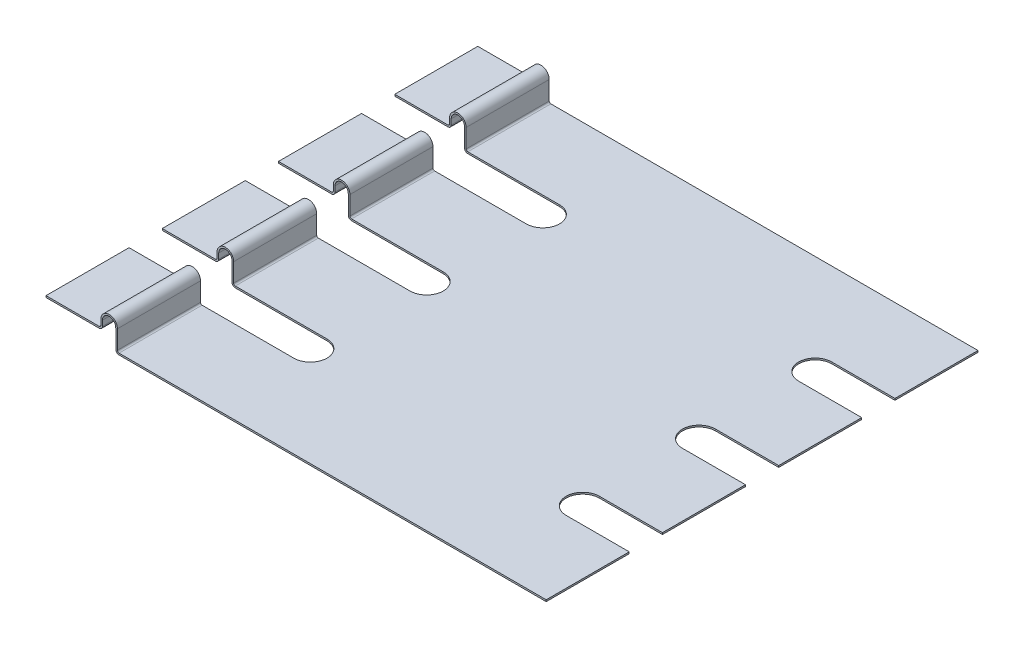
ISO-10303-21;
HEADER;
FILE_DESCRIPTION(('STEP AP214'),'2;1');
FILE_NAME('part.step','',(''),(''),'','','');
FILE_SCHEMA(('AUTOMOTIVE_DESIGN { 1 0 10303 214 1 1 1 1 }'));
ENDSEC;
DATA;
#1=APPLICATION_CONTEXT('core data for automotive mechanical design processes');
#2=APPLICATION_PROTOCOL_DEFINITION('international standard','automotive_design',2000,#1);
#3=PRODUCT_CONTEXT('',#1,'mechanical');
#4=PRODUCT('Part','Part','',(#3));
#5=PRODUCT_RELATED_PRODUCT_CATEGORY('part','',(#4));
#6=PRODUCT_DEFINITION_FORMATION('','',#4);
#7=PRODUCT_DEFINITION_CONTEXT('part definition',#1,'design');
#8=PRODUCT_DEFINITION('design','',#6,#7);
#9=PRODUCT_DEFINITION_SHAPE('','',#8);
#10=(LENGTH_UNIT() NAMED_UNIT(*) SI_UNIT(.MILLI.,.METRE.));
#11=(NAMED_UNIT(*) PLANE_ANGLE_UNIT() SI_UNIT($,.RADIAN.));
#12=(NAMED_UNIT(*) SI_UNIT($,.STERADIAN.) SOLID_ANGLE_UNIT());
#13=UNCERTAINTY_MEASURE_WITH_UNIT(LENGTH_MEASURE(1.E-05),#10,'distance_accuracy_value','');
#14=(GEOMETRIC_REPRESENTATION_CONTEXT(3) GLOBAL_UNCERTAINTY_ASSIGNED_CONTEXT((#13)) GLOBAL_UNIT_ASSIGNED_CONTEXT((#10,
#11,#12)) REPRESENTATION_CONTEXT('',''));
#15=CARTESIAN_POINT('',(0.,0.,0.));
#16=DIRECTION('',(0.,0.,1.));
#17=DIRECTION('',(1.,0.,0.));
#18=AXIS2_PLACEMENT_3D('',#15,#16,#17);
#19=CARTESIAN_POINT('',(1.1,-0.15,0.));
#20=DIRECTION('',(0.,0.,1.));
#21=DIRECTION('',(1.,0.,0.));
#22=AXIS2_PLACEMENT_3D('',#19,#20,#21);
#23=CYLINDRICAL_SURFACE('',#22,0.025);
#24=CARTESIAN_POINT('',(1.1,-0.15,3.5));
#25=DIRECTION('',(0.,0.,1.));
#26=DIRECTION('',(1.,0.,0.));
#27=AXIS2_PLACEMENT_3D('',#24,#25,#26);
#28=CIRCLE('',#27,0.025);
#29=CARTESIAN_POINT('',(1.1,-0.175,3.5));
#30=VERTEX_POINT('',#29);
#31=CARTESIAN_POINT('',(1.075,-0.15,3.5));
#32=VERTEX_POINT('',#31);
#33=EDGE_CURVE('E640',#30,#32,#28,.F.);
#34=ORIENTED_EDGE('',*,*,#33,.T.);
#35=DIRECTION('',(0.,0.,-1.));
#36=VECTOR('',#35,1.);
#37=CARTESIAN_POINT('',(1.075,-0.15,0.));
#38=LINE('',#37,#36);
#39=CARTESIAN_POINT('',(1.075,-0.15,4.75));
#40=VERTEX_POINT('',#39);
#41=EDGE_CURVE('E680',#40,#32,#38,.T.);
#42=ORIENTED_EDGE('',*,*,#41,.F.);
#43=CARTESIAN_POINT('',(1.1,-0.15,4.75));
#44=DIRECTION('',(0.,0.,1.));
#45=DIRECTION('',(1.,0.,0.));
#46=AXIS2_PLACEMENT_3D('',#43,#44,#45);
#47=CIRCLE('',#46,0.025);
#48=CARTESIAN_POINT('',(1.1,-0.175,4.75));
#49=VERTEX_POINT('',#48);
#50=EDGE_CURVE('E853',#40,#49,#47,.T.);
#51=ORIENTED_EDGE('',*,*,#50,.T.);
#52=DIRECTION('',(0.,0.,1.));
#53=VECTOR('',#52,1.);
#54=CARTESIAN_POINT('',(1.1,-0.175,0.));
#55=LINE('',#54,#53);
#56=EDGE_CURVE('E445',#30,#49,#55,.T.);
#57=ORIENTED_EDGE('',*,*,#56,.F.);
#58=EDGE_LOOP('',(#34,#42,#51,#57));
#59=FACE_BOUND('',#58,.T.);
#60=ADVANCED_FACE('F17',(#59),#23,.F.);
#61=CARTESIAN_POINT('',(1.075,0.13,0.));
#62=DIRECTION('',(1.,0.,0.));
#63=DIRECTION('',(0.,0.,-1.));
#64=AXIS2_PLACEMENT_3D('',#61,#62,#63);
#65=PLANE('',#64);
#66=DIRECTION('',(0.,1.,0.));
#67=VECTOR('',#66,1.);
#68=CARTESIAN_POINT('',(1.075,0.025,3.5));
#69=LINE('',#68,#67);
#70=CARTESIAN_POINT('',(1.075,0.13,3.5));
#71=VERTEX_POINT('',#70);
#72=EDGE_CURVE('E848',#32,#71,#69,.T.);
#73=ORIENTED_EDGE('',*,*,#72,.T.);
#74=DIRECTION('',(0.,0.,1.));
#75=VECTOR('',#74,1.);
#76=CARTESIAN_POINT('',(1.075,0.13,0.));
#77=LINE('',#76,#75);
#78=CARTESIAN_POINT('',(1.075,0.13,4.75));
#79=VERTEX_POINT('',#78);
#80=EDGE_CURVE('E677',#79,#71,#77,.F.);
#81=ORIENTED_EDGE('',*,*,#80,.F.);
#82=DIRECTION('',(0.,1.,0.));
#83=VECTOR('',#82,1.);
#84=CARTESIAN_POINT('',(1.075,0.025,4.75));
#85=LINE('',#84,#83);
#86=EDGE_CURVE('E855',#79,#40,#85,.F.);
#87=ORIENTED_EDGE('',*,*,#86,.T.);
#88=ORIENTED_EDGE('',*,*,#41,.T.);
#89=EDGE_LOOP('',(#73,#81,#87,#88));
#90=FACE_BOUND('',#89,.T.);
#91=ADVANCED_FACE('F1345',(#90),#65,.T.);
#92=CARTESIAN_POINT('',(0.95,0.13,0.));
#93=DIRECTION('',(0.,0.,1.));
#94=DIRECTION('',(1.,0.,0.));
#95=AXIS2_PLACEMENT_3D('',#92,#93,#94);
#96=CYLINDRICAL_SURFACE('',#95,0.125);
#97=CARTESIAN_POINT('',(0.95,0.13,3.5));
#98=DIRECTION('',(0.,0.,1.));
#99=DIRECTION('',(1.,0.,0.));
#100=AXIS2_PLACEMENT_3D('',#97,#98,#99);
#101=CIRCLE('',#100,0.125);
#102=CARTESIAN_POINT('',(0.825,0.13,3.5));
#103=VERTEX_POINT('',#102);
#104=EDGE_CURVE('E846',#71,#103,#101,.T.);
#105=ORIENTED_EDGE('',*,*,#104,.T.);
#106=DIRECTION('',(0.,0.,1.));
#107=VECTOR('',#106,1.);
#108=CARTESIAN_POINT('',(0.825,0.13,0.));
#109=LINE('',#108,#107);
#110=CARTESIAN_POINT('',(0.825,0.13,4.75));
#111=VERTEX_POINT('',#110);
#112=EDGE_CURVE('E674',#111,#103,#109,.F.);
#113=ORIENTED_EDGE('',*,*,#112,.F.);
#114=CARTESIAN_POINT('',(0.95,0.13,4.75));
#115=DIRECTION('',(0.,0.,1.));
#116=DIRECTION('',(1.,0.,0.));
#117=AXIS2_PLACEMENT_3D('',#114,#115,#116);
#118=CIRCLE('',#117,0.125);
#119=EDGE_CURVE('E856',#111,#79,#118,.F.);
#120=ORIENTED_EDGE('',*,*,#119,.T.);
#121=ORIENTED_EDGE('',*,*,#80,.T.);
#122=EDGE_LOOP('',(#105,#113,#120,#121));
#123=FACE_BOUND('',#122,.T.);
#124=ADVANCED_FACE('F1348',(#123),#96,.T.);
#125=CARTESIAN_POINT('',(0.825,0.05,0.));
#126=DIRECTION('',(-1.,0.,0.));
#127=DIRECTION('',(0.,0.,1.));
#128=AXIS2_PLACEMENT_3D('',#125,#126,#127);
#129=PLANE('',#128);
#130=DIRECTION('',(0.,1.,0.));
#131=VECTOR('',#130,1.);
#132=CARTESIAN_POINT('',(0.825,0.025,3.5));
#133=LINE('',#132,#131);
#134=CARTESIAN_POINT('',(0.825,0.05,3.5));
#135=VERTEX_POINT('',#134);
#136=EDGE_CURVE('E845',#103,#135,#133,.F.);
#137=ORIENTED_EDGE('',*,*,#136,.T.);
#138=DIRECTION('',(0.,0.,1.));
#139=VECTOR('',#138,1.);
#140=CARTESIAN_POINT('',(0.825,0.05,0.));
#141=LINE('',#140,#139);
#142=CARTESIAN_POINT('',(0.825,0.05,4.75));
#143=VERTEX_POINT('',#142);
#144=EDGE_CURVE('E672',#135,#143,#141,.T.);
#145=ORIENTED_EDGE('',*,*,#144,.T.);
#146=DIRECTION('',(0.,1.,0.));
#147=VECTOR('',#146,1.);
#148=CARTESIAN_POINT('',(0.825,0.025,4.75));
#149=LINE('',#148,#147);
#150=EDGE_CURVE('E859',#143,#111,#149,.T.);
#151=ORIENTED_EDGE('',*,*,#150,.T.);
#152=ORIENTED_EDGE('',*,*,#112,.T.);
#153=EDGE_LOOP('',(#137,#145,#151,#152));
#154=FACE_BOUND('',#153,.T.);
#155=ADVANCED_FACE('F1353',(#154),#129,.T.);
#156=CARTESIAN_POINT('',(0.8,0.05,0.));
#157=DIRECTION('',(0.,0.,1.));
#158=DIRECTION('',(1.,0.,0.));
#159=AXIS2_PLACEMENT_3D('',#156,#157,#158);
#160=CYLINDRICAL_SURFACE('',#159,0.025);
#161=CARTESIAN_POINT('',(0.8,0.05,3.5));
#162=DIRECTION('',(0.,0.,1.));
#163=DIRECTION('',(1.,0.,0.));
#164=AXIS2_PLACEMENT_3D('',#161,#162,#163);
#165=CIRCLE('',#164,0.025);
#166=CARTESIAN_POINT('',(0.8,0.025,3.5));
#167=VERTEX_POINT('',#166);
#168=EDGE_CURVE('E843',#135,#167,#165,.F.);
#169=ORIENTED_EDGE('',*,*,#168,.T.);
#170=DIRECTION('',(0.,0.,1.));
#171=VECTOR('',#170,1.);
#172=CARTESIAN_POINT('',(0.8,0.025,0.));
#173=LINE('',#172,#171);
#174=CARTESIAN_POINT('',(0.8,0.025,4.75));
#175=VERTEX_POINT('',#174);
#176=EDGE_CURVE('E667',#175,#167,#173,.F.);
#177=ORIENTED_EDGE('',*,*,#176,.F.);
#178=CARTESIAN_POINT('',(0.8,0.05,4.75));
#179=DIRECTION('',(0.,0.,1.));
#180=DIRECTION('',(1.,0.,0.));
#181=AXIS2_PLACEMENT_3D('',#178,#179,#180);
#182=CIRCLE('',#181,0.025);
#183=EDGE_CURVE('E860',#175,#143,#182,.T.);
#184=ORIENTED_EDGE('',*,*,#183,.T.);
#185=ORIENTED_EDGE('',*,*,#144,.F.);
#186=EDGE_LOOP('',(#169,#177,#184,#185));
#187=FACE_BOUND('',#186,.T.);
#188=ADVANCED_FACE('F1358',(#187),#160,.F.);
#189=CARTESIAN_POINT('',(0.,0.025,0.));
#190=DIRECTION('',(0.,1.,0.));
#191=DIRECTION('',(0.,0.,1.));
#192=AXIS2_PLACEMENT_3D('',#189,#190,#191);
#193=PLANE('',#192);
#194=DIRECTION('',(1.,0.,0.));
#195=VECTOR('',#194,1.);
#196=CARTESIAN_POINT('',(2.48,0.025,3.5));
#197=LINE('',#196,#195);
#198=CARTESIAN_POINT('',(0.,0.025,3.5));
#199=VERTEX_POINT('',#198);
#200=EDGE_CURVE('E662',#167,#199,#197,.F.);
#201=ORIENTED_EDGE('',*,*,#200,.T.);
#202=DIRECTION('',(0.,0.,1.));
#203=VECTOR('',#202,1.);
#204=CARTESIAN_POINT('',(0.,0.025,0.));
#205=LINE('',#204,#203);
#206=CARTESIAN_POINT('',(0.,0.025,4.75));
#207=VERTEX_POINT('',#206);
#208=EDGE_CURVE('E655',#207,#199,#205,.F.);
#209=ORIENTED_EDGE('',*,*,#208,.F.);
#210=DIRECTION('',(-1.,0.,0.));
#211=VECTOR('',#210,1.);
#212=CARTESIAN_POINT('',(0.,0.025,4.75));
#213=LINE('',#212,#211);
#214=EDGE_CURVE('E686',#207,#175,#213,.F.);
#215=ORIENTED_EDGE('',*,*,#214,.T.);
#216=ORIENTED_EDGE('',*,*,#176,.T.);
#217=EDGE_LOOP('',(#201,#209,#215,#216));
#218=FACE_BOUND('',#217,.T.);
#219=ADVANCED_FACE('F1361',(#218),#193,.T.);
#220=CARTESIAN_POINT('',(0.,0.,0.));
#221=DIRECTION('',(-1.,0.,0.));
#222=DIRECTION('',(0.,0.,1.));
#223=AXIS2_PLACEMENT_3D('',#220,#221,#222);
#224=PLANE('',#223);
#225=DIRECTION('',(0.,1.,0.));
#226=VECTOR('',#225,1.);
#227=CARTESIAN_POINT('',(0.,0.025,3.5));
#228=LINE('',#227,#226);
#229=CARTESIAN_POINT('',(0.,0.,3.5));
#230=VERTEX_POINT('',#229);
#231=EDGE_CURVE('E658',#199,#230,#228,.F.);
#232=ORIENTED_EDGE('',*,*,#231,.T.);
#233=DIRECTION('',(0.,0.,-1.));
#234=VECTOR('',#233,1.);
#235=CARTESIAN_POINT('',(0.,0.,0.));
#236=LINE('',#235,#234);
#237=CARTESIAN_POINT('',(0.,0.,4.75));
#238=VERTEX_POINT('',#237);
#239=EDGE_CURVE('E652',#238,#230,#236,.T.);
#240=ORIENTED_EDGE('',*,*,#239,.F.);
#241=DIRECTION('',(0.,1.,0.));
#242=VECTOR('',#241,1.);
#243=CARTESIAN_POINT('',(0.,0.025,4.75));
#244=LINE('',#243,#242);
#245=EDGE_CURVE('E683',#238,#207,#244,.T.);
#246=ORIENTED_EDGE('',*,*,#245,.T.);
#247=ORIENTED_EDGE('',*,*,#208,.T.);
#248=EDGE_LOOP('',(#232,#240,#246,#247));
#249=FACE_BOUND('',#248,.T.);
#250=ADVANCED_FACE('F1366',(#249),#224,.T.);
#251=CARTESIAN_POINT('',(0.8,0.,0.));
#252=DIRECTION('',(0.,-1.,0.));
#253=DIRECTION('',(0.,0.,-1.));
#254=AXIS2_PLACEMENT_3D('',#251,#252,#253);
#255=PLANE('',#254);
#256=DIRECTION('',(1.,0.,0.));
#257=VECTOR('',#256,1.);
#258=CARTESIAN_POINT('',(2.48,0.,3.5));
#259=LINE('',#258,#257);
#260=CARTESIAN_POINT('',(0.8,0.,3.5));
#261=VERTEX_POINT('',#260);
#262=EDGE_CURVE('E661',#230,#261,#259,.T.);
#263=ORIENTED_EDGE('',*,*,#262,.T.);
#264=DIRECTION('',(0.,0.,1.));
#265=VECTOR('',#264,1.);
#266=CARTESIAN_POINT('',(0.8,0.,0.));
#267=LINE('',#266,#265);
#268=CARTESIAN_POINT('',(0.8,0.,4.75));
#269=VERTEX_POINT('',#268);
#270=EDGE_CURVE('E649',#269,#261,#267,.F.);
#271=ORIENTED_EDGE('',*,*,#270,.F.);
#272=DIRECTION('',(-1.,0.,0.));
#273=VECTOR('',#272,1.);
#274=CARTESIAN_POINT('',(0.,0.,4.75));
#275=LINE('',#274,#273);
#276=EDGE_CURVE('E687',#269,#238,#275,.T.);
#277=ORIENTED_EDGE('',*,*,#276,.T.);
#278=ORIENTED_EDGE('',*,*,#239,.T.);
#279=EDGE_LOOP('',(#263,#271,#277,#278));
#280=FACE_BOUND('',#279,.T.);
#281=ADVANCED_FACE('F1370',(#280),#255,.T.);
#282=CARTESIAN_POINT('',(0.8,0.05,0.));
#283=DIRECTION('',(0.,0.,1.));
#284=DIRECTION('',(1.,0.,0.));
#285=AXIS2_PLACEMENT_3D('',#282,#283,#284);
#286=CYLINDRICAL_SURFACE('',#285,0.05);
#287=CARTESIAN_POINT('',(0.8,0.05,3.5));
#288=DIRECTION('',(0.,0.,1.));
#289=DIRECTION('',(1.,0.,0.));
#290=AXIS2_PLACEMENT_3D('',#287,#288,#289);
#291=CIRCLE('',#290,0.05);
#292=CARTESIAN_POINT('',(0.85,0.05,3.5));
#293=VERTEX_POINT('',#292);
#294=EDGE_CURVE('E841',#261,#293,#291,.T.);
#295=ORIENTED_EDGE('',*,*,#294,.T.);
#296=DIRECTION('',(0.,0.,-1.));
#297=VECTOR('',#296,1.);
#298=CARTESIAN_POINT('',(0.85,0.05,0.));
#299=LINE('',#298,#297);
#300=CARTESIAN_POINT('',(0.85,0.05,4.75));
#301=VERTEX_POINT('',#300);
#302=EDGE_CURVE('E646',#301,#293,#299,.T.);
#303=ORIENTED_EDGE('',*,*,#302,.F.);
#304=CARTESIAN_POINT('',(0.8,0.05,4.75));
#305=DIRECTION('',(0.,0.,1.));
#306=DIRECTION('',(1.,0.,0.));
#307=AXIS2_PLACEMENT_3D('',#304,#305,#306);
#308=CIRCLE('',#307,0.05);
#309=EDGE_CURVE('E863',#301,#269,#308,.F.);
#310=ORIENTED_EDGE('',*,*,#309,.T.);
#311=ORIENTED_EDGE('',*,*,#270,.T.);
#312=EDGE_LOOP('',(#295,#303,#310,#311));
#313=FACE_BOUND('',#312,.T.);
#314=ADVANCED_FACE('F1373',(#313),#286,.T.);
#315=CARTESIAN_POINT('',(0.85,0.13,0.));
#316=DIRECTION('',(1.,0.,0.));
#317=DIRECTION('',(0.,0.,-1.));
#318=AXIS2_PLACEMENT_3D('',#315,#316,#317);
#319=PLANE('',#318);
#320=DIRECTION('',(0.,1.,0.));
#321=VECTOR('',#320,1.);
#322=CARTESIAN_POINT('',(0.85,0.025,3.5));
#323=LINE('',#322,#321);
#324=CARTESIAN_POINT('',(0.85,0.13,3.5));
#325=VERTEX_POINT('',#324);
#326=EDGE_CURVE('E840',#293,#325,#323,.T.);
#327=ORIENTED_EDGE('',*,*,#326,.T.);
#328=DIRECTION('',(0.,0.,1.));
#329=VECTOR('',#328,1.);
#330=CARTESIAN_POINT('',(0.85,0.13,0.));
#331=LINE('',#330,#329);
#332=CARTESIAN_POINT('',(0.85,0.13,4.75));
#333=VERTEX_POINT('',#332);
#334=EDGE_CURVE('E644',#325,#333,#331,.T.);
#335=ORIENTED_EDGE('',*,*,#334,.T.);
#336=DIRECTION('',(0.,1.,0.));
#337=VECTOR('',#336,1.);
#338=CARTESIAN_POINT('',(0.85,0.025,4.75));
#339=LINE('',#338,#337);
#340=EDGE_CURVE('E866',#333,#301,#339,.F.);
#341=ORIENTED_EDGE('',*,*,#340,.T.);
#342=ORIENTED_EDGE('',*,*,#302,.T.);
#343=EDGE_LOOP('',(#327,#335,#341,#342));
#344=FACE_BOUND('',#343,.T.);
#345=ADVANCED_FACE('F1377',(#344),#319,.T.);
#346=CARTESIAN_POINT('',(0.95,0.13,0.));
#347=DIRECTION('',(0.,0.,1.));
#348=DIRECTION('',(1.,0.,0.));
#349=AXIS2_PLACEMENT_3D('',#346,#347,#348);
#350=CYLINDRICAL_SURFACE('',#349,0.1);
#351=CARTESIAN_POINT('',(0.95,0.13,3.5));
#352=DIRECTION('',(0.,0.,1.));
#353=DIRECTION('',(1.,0.,0.));
#354=AXIS2_PLACEMENT_3D('',#351,#352,#353);
#355=CIRCLE('',#354,0.1);
#356=CARTESIAN_POINT('',(1.05,0.13,3.5));
#357=VERTEX_POINT('',#356);
#358=EDGE_CURVE('E838',#325,#357,#355,.F.);
#359=ORIENTED_EDGE('',*,*,#358,.T.);
#360=DIRECTION('',(0.,0.,1.));
#361=VECTOR('',#360,1.);
#362=CARTESIAN_POINT('',(1.05,0.13,0.));
#363=LINE('',#362,#361);
#364=CARTESIAN_POINT('',(1.05,0.13,4.75));
#365=VERTEX_POINT('',#364);
#366=EDGE_CURVE('E627',#365,#357,#363,.F.);
#367=ORIENTED_EDGE('',*,*,#366,.F.);
#368=CARTESIAN_POINT('',(0.95,0.13,4.75));
#369=DIRECTION('',(0.,0.,1.));
#370=DIRECTION('',(1.,0.,0.));
#371=AXIS2_PLACEMENT_3D('',#368,#369,#370);
#372=CIRCLE('',#371,0.1);
#373=EDGE_CURVE('E867',#365,#333,#372,.T.);
#374=ORIENTED_EDGE('',*,*,#373,.T.);
#375=ORIENTED_EDGE('',*,*,#334,.F.);
#376=EDGE_LOOP('',(#359,#367,#374,#375));
#377=FACE_BOUND('',#376,.T.);
#378=ADVANCED_FACE('F1382',(#377),#350,.F.);
#379=CARTESIAN_POINT('',(1.05,-0.15,0.));
#380=DIRECTION('',(-1.,0.,0.));
#381=DIRECTION('',(0.,0.,1.));
#382=AXIS2_PLACEMENT_3D('',#379,#380,#381);
#383=PLANE('',#382);
#384=DIRECTION('',(0.,1.,0.));
#385=VECTOR('',#384,1.);
#386=CARTESIAN_POINT('',(1.05,0.025,3.5));
#387=LINE('',#386,#385);
#388=CARTESIAN_POINT('',(1.05,-0.15,3.5));
#389=VERTEX_POINT('',#388);
#390=EDGE_CURVE('E837',#357,#389,#387,.F.);
#391=ORIENTED_EDGE('',*,*,#390,.T.);
#392=DIRECTION('',(0.,0.,1.));
#393=VECTOR('',#392,1.);
#394=CARTESIAN_POINT('',(1.05,-0.15,0.));
#395=LINE('',#394,#393);
#396=CARTESIAN_POINT('',(1.05,-0.15,4.75));
#397=VERTEX_POINT('',#396);
#398=EDGE_CURVE('E637',#397,#389,#395,.F.);
#399=ORIENTED_EDGE('',*,*,#398,.F.);
#400=DIRECTION('',(0.,1.,0.));
#401=VECTOR('',#400,1.);
#402=CARTESIAN_POINT('',(1.05,0.025,4.75));
#403=LINE('',#402,#401);
#404=EDGE_CURVE('E870',#397,#365,#403,.T.);
#405=ORIENTED_EDGE('',*,*,#404,.T.);
#406=ORIENTED_EDGE('',*,*,#366,.T.);
#407=EDGE_LOOP('',(#391,#399,#405,#406));
#408=FACE_BOUND('',#407,.T.);
#409=ADVANCED_FACE('F1386',(#408),#383,.T.);
#410=CARTESIAN_POINT('',(1.1,-0.15,0.));
#411=DIRECTION('',(0.,0.,1.));
#412=DIRECTION('',(1.,0.,0.));
#413=AXIS2_PLACEMENT_3D('',#410,#411,#412);
#414=CYLINDRICAL_SURFACE('',#413,0.025);
#415=CARTESIAN_POINT('',(1.1,-0.15,3.));
#416=DIRECTION('',(0.,0.,1.));
#417=DIRECTION('',(1.,0.,0.));
#418=AXIS2_PLACEMENT_3D('',#415,#416,#417);
#419=CIRCLE('',#418,0.025);
#420=CARTESIAN_POINT('',(1.075,-0.15,3.));
#421=VERTEX_POINT('',#420);
#422=CARTESIAN_POINT('',(1.1,-0.175,3.));
#423=VERTEX_POINT('',#422);
#424=EDGE_CURVE('E813',#421,#423,#419,.T.);
#425=ORIENTED_EDGE('',*,*,#424,.T.);
#426=DIRECTION('',(0.,0.,1.));
#427=VECTOR('',#426,1.);
#428=CARTESIAN_POINT('',(1.1,-0.175,0.));
#429=LINE('',#428,#427);
#430=CARTESIAN_POINT('',(1.1,-0.175,1.75));
#431=VERTEX_POINT('',#430);
#432=EDGE_CURVE('E558',#431,#423,#429,.T.);
#433=ORIENTED_EDGE('',*,*,#432,.F.);
#434=CARTESIAN_POINT('',(1.1,-0.15,1.75));
#435=DIRECTION('',(0.,0.,1.));
#436=DIRECTION('',(1.,0.,0.));
#437=AXIS2_PLACEMENT_3D('',#434,#435,#436);
#438=CIRCLE('',#437,0.025);
#439=CARTESIAN_POINT('',(1.075,-0.15,1.75));
#440=VERTEX_POINT('',#439);
#441=EDGE_CURVE('E584',#431,#440,#438,.F.);
#442=ORIENTED_EDGE('',*,*,#441,.T.);
#443=DIRECTION('',(0.,0.,-1.));
#444=VECTOR('',#443,1.);
#445=CARTESIAN_POINT('',(1.075,-0.15,0.));
#446=LINE('',#445,#444);
#447=EDGE_CURVE('E624',#421,#440,#446,.T.);
#448=ORIENTED_EDGE('',*,*,#447,.F.);
#449=EDGE_LOOP('',(#425,#433,#442,#448));
#450=FACE_BOUND('',#449,.T.);
#451=ADVANCED_FACE('F1317',(#450),#414,.F.);
#452=CARTESIAN_POINT('',(1.075,0.13,0.));
#453=DIRECTION('',(1.,0.,0.));
#454=DIRECTION('',(0.,0.,-1.));
#455=AXIS2_PLACEMENT_3D('',#452,#453,#454);
#456=PLANE('',#455);
#457=DIRECTION('',(0.,1.,0.));
#458=VECTOR('',#457,1.);
#459=CARTESIAN_POINT('',(1.075,0.025,3.));
#460=LINE('',#459,#458);
#461=CARTESIAN_POINT('',(1.075,0.13,3.));
#462=VERTEX_POINT('',#461);
#463=EDGE_CURVE('E815',#462,#421,#460,.F.);
#464=ORIENTED_EDGE('',*,*,#463,.T.);
#465=ORIENTED_EDGE('',*,*,#447,.T.);
#466=DIRECTION('',(0.,1.,0.));
#467=VECTOR('',#466,1.);
#468=CARTESIAN_POINT('',(1.075,0.025,1.75));
#469=LINE('',#468,#467);
#470=CARTESIAN_POINT('',(1.075,0.13,1.75));
#471=VERTEX_POINT('',#470);
#472=EDGE_CURVE('E808',#440,#471,#469,.T.);
#473=ORIENTED_EDGE('',*,*,#472,.T.);
#474=DIRECTION('',(0.,0.,1.));
#475=VECTOR('',#474,1.);
#476=CARTESIAN_POINT('',(1.075,0.13,0.));
#477=LINE('',#476,#475);
#478=EDGE_CURVE('E621',#462,#471,#477,.F.);
#479=ORIENTED_EDGE('',*,*,#478,.F.);
#480=EDGE_LOOP('',(#464,#465,#473,#479));
#481=FACE_BOUND('',#480,.T.);
#482=ADVANCED_FACE('F1319',(#481),#456,.T.);
#483=CARTESIAN_POINT('',(0.95,0.13,0.));
#484=DIRECTION('',(0.,0.,1.));
#485=DIRECTION('',(1.,0.,0.));
#486=AXIS2_PLACEMENT_3D('',#483,#484,#485);
#487=CYLINDRICAL_SURFACE('',#486,0.125);
#488=CARTESIAN_POINT('',(0.95,0.13,3.));
#489=DIRECTION('',(0.,0.,1.));
#490=DIRECTION('',(1.,0.,0.));
#491=AXIS2_PLACEMENT_3D('',#488,#489,#490);
#492=CIRCLE('',#491,0.125);
#493=CARTESIAN_POINT('',(0.825,0.13,3.));
#494=VERTEX_POINT('',#493);
#495=EDGE_CURVE('E816',#494,#462,#492,.F.);
#496=ORIENTED_EDGE('',*,*,#495,.T.);
#497=ORIENTED_EDGE('',*,*,#478,.T.);
#498=CARTESIAN_POINT('',(0.95,0.13,1.75));
#499=DIRECTION('',(0.,0.,1.));
#500=DIRECTION('',(1.,0.,0.));
#501=AXIS2_PLACEMENT_3D('',#498,#499,#500);
#502=CIRCLE('',#501,0.125);
#503=CARTESIAN_POINT('',(0.825,0.13,1.75));
#504=VERTEX_POINT('',#503);
#505=EDGE_CURVE('E806',#471,#504,#502,.T.);
#506=ORIENTED_EDGE('',*,*,#505,.T.);
#507=DIRECTION('',(0.,0.,1.));
#508=VECTOR('',#507,1.);
#509=CARTESIAN_POINT('',(0.825,0.13,0.));
#510=LINE('',#509,#508);
#511=EDGE_CURVE('E618',#494,#504,#510,.F.);
#512=ORIENTED_EDGE('',*,*,#511,.F.);
#513=EDGE_LOOP('',(#496,#497,#506,#512));
#514=FACE_BOUND('',#513,.T.);
#515=ADVANCED_FACE('F1952',(#514),#487,.T.);
#516=CARTESIAN_POINT('',(0.825,0.05,0.));
#517=DIRECTION('',(-1.,0.,0.));
#518=DIRECTION('',(0.,0.,1.));
#519=AXIS2_PLACEMENT_3D('',#516,#517,#518);
#520=PLANE('',#519);
#521=DIRECTION('',(0.,1.,0.));
#522=VECTOR('',#521,1.);
#523=CARTESIAN_POINT('',(0.825,0.025,3.));
#524=LINE('',#523,#522);
#525=CARTESIAN_POINT('',(0.825,0.05,3.));
#526=VERTEX_POINT('',#525);
#527=EDGE_CURVE('E819',#526,#494,#524,.T.);
#528=ORIENTED_EDGE('',*,*,#527,.T.);
#529=ORIENTED_EDGE('',*,*,#511,.T.);
#530=DIRECTION('',(0.,1.,0.));
#531=VECTOR('',#530,1.);
#532=CARTESIAN_POINT('',(0.825,0.025,1.75));
#533=LINE('',#532,#531);
#534=CARTESIAN_POINT('',(0.825,0.05,1.75));
#535=VERTEX_POINT('',#534);
#536=EDGE_CURVE('E805',#504,#535,#533,.F.);
#537=ORIENTED_EDGE('',*,*,#536,.T.);
#538=DIRECTION('',(0.,0.,1.));
#539=VECTOR('',#538,1.);
#540=CARTESIAN_POINT('',(0.825,0.05,0.));
#541=LINE('',#540,#539);
#542=EDGE_CURVE('E616',#535,#526,#541,.T.);
#543=ORIENTED_EDGE('',*,*,#542,.T.);
#544=EDGE_LOOP('',(#528,#529,#537,#543));
#545=FACE_BOUND('',#544,.T.);
#546=ADVANCED_FACE('F1943',(#545),#520,.T.);
#547=CARTESIAN_POINT('',(0.8,0.05,0.));
#548=DIRECTION('',(0.,0.,1.));
#549=DIRECTION('',(1.,0.,0.));
#550=AXIS2_PLACEMENT_3D('',#547,#548,#549);
#551=CYLINDRICAL_SURFACE('',#550,0.025);
#552=CARTESIAN_POINT('',(0.8,0.05,3.));
#553=DIRECTION('',(0.,0.,1.));
#554=DIRECTION('',(1.,0.,0.));
#555=AXIS2_PLACEMENT_3D('',#552,#553,#554);
#556=CIRCLE('',#555,0.025);
#557=CARTESIAN_POINT('',(0.8,0.025,3.));
#558=VERTEX_POINT('',#557);
#559=EDGE_CURVE('E820',#558,#526,#556,.T.);
#560=ORIENTED_EDGE('',*,*,#559,.T.);
#561=ORIENTED_EDGE('',*,*,#542,.F.);
#562=CARTESIAN_POINT('',(0.8,0.05,1.75));
#563=DIRECTION('',(0.,0.,1.));
#564=DIRECTION('',(1.,0.,0.));
#565=AXIS2_PLACEMENT_3D('',#562,#563,#564);
#566=CIRCLE('',#565,0.025);
#567=CARTESIAN_POINT('',(0.8,0.025,1.75));
#568=VERTEX_POINT('',#567);
#569=EDGE_CURVE('E803',#535,#568,#566,.F.);
#570=ORIENTED_EDGE('',*,*,#569,.T.);
#571=DIRECTION('',(0.,0.,1.));
#572=VECTOR('',#571,1.);
#573=CARTESIAN_POINT('',(0.8,0.025,0.));
#574=LINE('',#573,#572);
#575=EDGE_CURVE('E611',#558,#568,#574,.F.);
#576=ORIENTED_EDGE('',*,*,#575,.F.);
#577=EDGE_LOOP('',(#560,#561,#570,#576));
#578=FACE_BOUND('',#577,.T.);
#579=ADVANCED_FACE('F1934',(#578),#551,.F.);
#580=CARTESIAN_POINT('',(0.,0.025,0.));
#581=DIRECTION('',(0.,1.,0.));
#582=DIRECTION('',(0.,0.,1.));
#583=AXIS2_PLACEMENT_3D('',#580,#581,#582);
#584=PLANE('',#583);
#585=DIRECTION('',(-1.,0.,0.));
#586=VECTOR('',#585,1.);
#587=CARTESIAN_POINT('',(0.,0.025,3.));
#588=LINE('',#587,#586);
#589=CARTESIAN_POINT('',(0.,0.025,3.));
#590=VERTEX_POINT('',#589);
#591=EDGE_CURVE('E631',#590,#558,#588,.F.);
#592=ORIENTED_EDGE('',*,*,#591,.T.);
#593=ORIENTED_EDGE('',*,*,#575,.T.);
#594=DIRECTION('',(1.,0.,0.));
#595=VECTOR('',#594,1.);
#596=CARTESIAN_POINT('',(2.48,0.025,1.75));
#597=LINE('',#596,#595);
#598=CARTESIAN_POINT('',(0.,0.025,1.75));
#599=VERTEX_POINT('',#598);
#600=EDGE_CURVE('E606',#568,#599,#597,.F.);
#601=ORIENTED_EDGE('',*,*,#600,.T.);
#602=DIRECTION('',(0.,0.,1.));
#603=VECTOR('',#602,1.);
#604=CARTESIAN_POINT('',(0.,0.025,0.));
#605=LINE('',#604,#603);
#606=EDGE_CURVE('E599',#590,#599,#605,.F.);
#607=ORIENTED_EDGE('',*,*,#606,.F.);
#608=EDGE_LOOP('',(#592,#593,#601,#607));
#609=FACE_BOUND('',#608,.T.);
#610=ADVANCED_FACE('F1925',(#609),#584,.T.);
#611=CARTESIAN_POINT('',(0.,0.,0.));
#612=DIRECTION('',(-1.,0.,0.));
#613=DIRECTION('',(0.,0.,1.));
#614=AXIS2_PLACEMENT_3D('',#611,#612,#613);
#615=PLANE('',#614);
#616=DIRECTION('',(0.,1.,0.));
#617=VECTOR('',#616,1.);
#618=CARTESIAN_POINT('',(0.,0.025,3.));
#619=LINE('',#618,#617);
#620=CARTESIAN_POINT('',(0.,0.,3.));
#621=VERTEX_POINT('',#620);
#622=EDGE_CURVE('E628',#621,#590,#619,.T.);
#623=ORIENTED_EDGE('',*,*,#622,.T.);
#624=ORIENTED_EDGE('',*,*,#606,.T.);
#625=DIRECTION('',(0.,1.,0.));
#626=VECTOR('',#625,1.);
#627=CARTESIAN_POINT('',(0.,0.025,1.75));
#628=LINE('',#627,#626);
#629=CARTESIAN_POINT('',(0.,0.,1.75));
#630=VERTEX_POINT('',#629);
#631=EDGE_CURVE('E602',#599,#630,#628,.F.);
#632=ORIENTED_EDGE('',*,*,#631,.T.);
#633=DIRECTION('',(0.,0.,-1.));
#634=VECTOR('',#633,1.);
#635=CARTESIAN_POINT('',(0.,0.,0.));
#636=LINE('',#635,#634);
#637=EDGE_CURVE('E596',#621,#630,#636,.T.);
#638=ORIENTED_EDGE('',*,*,#637,.F.);
#639=EDGE_LOOP('',(#623,#624,#632,#638));
#640=FACE_BOUND('',#639,.T.);
#641=ADVANCED_FACE('F1916',(#640),#615,.T.);
#642=CARTESIAN_POINT('',(0.8,0.,0.));
#643=DIRECTION('',(0.,-1.,0.));
#644=DIRECTION('',(0.,0.,-1.));
#645=AXIS2_PLACEMENT_3D('',#642,#643,#644);
#646=PLANE('',#645);
#647=DIRECTION('',(-1.,0.,0.));
#648=VECTOR('',#647,1.);
#649=CARTESIAN_POINT('',(0.,0.,3.));
#650=LINE('',#649,#648);
#651=CARTESIAN_POINT('',(0.8,0.,3.));
#652=VERTEX_POINT('',#651);
#653=EDGE_CURVE('E632',#652,#621,#650,.T.);
#654=ORIENTED_EDGE('',*,*,#653,.T.);
#655=ORIENTED_EDGE('',*,*,#637,.T.);
#656=DIRECTION('',(1.,0.,0.));
#657=VECTOR('',#656,1.);
#658=CARTESIAN_POINT('',(2.48,0.,1.75));
#659=LINE('',#658,#657);
#660=CARTESIAN_POINT('',(0.8,0.,1.75));
#661=VERTEX_POINT('',#660);
#662=EDGE_CURVE('E605',#630,#661,#659,.T.);
#663=ORIENTED_EDGE('',*,*,#662,.T.);
#664=DIRECTION('',(0.,0.,1.));
#665=VECTOR('',#664,1.);
#666=CARTESIAN_POINT('',(0.8,0.,0.));
#667=LINE('',#666,#665);
#668=EDGE_CURVE('E593',#652,#661,#667,.F.);
#669=ORIENTED_EDGE('',*,*,#668,.F.);
#670=EDGE_LOOP('',(#654,#655,#663,#669));
#671=FACE_BOUND('',#670,.T.);
#672=ADVANCED_FACE('F1907',(#671),#646,.T.);
#673=CARTESIAN_POINT('',(0.8,0.05,0.));
#674=DIRECTION('',(0.,0.,1.));
#675=DIRECTION('',(1.,0.,0.));
#676=AXIS2_PLACEMENT_3D('',#673,#674,#675);
#677=CYLINDRICAL_SURFACE('',#676,0.05);
#678=CARTESIAN_POINT('',(0.8,0.05,3.));
#679=DIRECTION('',(0.,0.,1.));
#680=DIRECTION('',(1.,0.,0.));
#681=AXIS2_PLACEMENT_3D('',#678,#679,#680);
#682=CIRCLE('',#681,0.05);
#683=CARTESIAN_POINT('',(0.85,0.05,3.));
#684=VERTEX_POINT('',#683);
#685=EDGE_CURVE('E823',#684,#652,#682,.F.);
#686=ORIENTED_EDGE('',*,*,#685,.T.);
#687=ORIENTED_EDGE('',*,*,#668,.T.);
#688=CARTESIAN_POINT('',(0.8,0.05,1.75));
#689=DIRECTION('',(0.,0.,1.));
#690=DIRECTION('',(1.,0.,0.));
#691=AXIS2_PLACEMENT_3D('',#688,#689,#690);
#692=CIRCLE('',#691,0.05);
#693=CARTESIAN_POINT('',(0.85,0.05,1.75));
#694=VERTEX_POINT('',#693);
#695=EDGE_CURVE('E801',#661,#694,#692,.T.);
#696=ORIENTED_EDGE('',*,*,#695,.T.);
#697=DIRECTION('',(0.,0.,-1.));
#698=VECTOR('',#697,1.);
#699=CARTESIAN_POINT('',(0.85,0.05,0.));
#700=LINE('',#699,#698);
#701=EDGE_CURVE('E590',#684,#694,#700,.T.);
#702=ORIENTED_EDGE('',*,*,#701,.F.);
#703=EDGE_LOOP('',(#686,#687,#696,#702));
#704=FACE_BOUND('',#703,.T.);
#705=ADVANCED_FACE('F1898',(#704),#677,.T.);
#706=CARTESIAN_POINT('',(0.85,0.13,0.));
#707=DIRECTION('',(1.,0.,0.));
#708=DIRECTION('',(0.,0.,-1.));
#709=AXIS2_PLACEMENT_3D('',#706,#707,#708);
#710=PLANE('',#709);
#711=DIRECTION('',(0.,1.,0.));
#712=VECTOR('',#711,1.);
#713=CARTESIAN_POINT('',(0.85,0.025,3.));
#714=LINE('',#713,#712);
#715=CARTESIAN_POINT('',(0.85,0.13,3.));
#716=VERTEX_POINT('',#715);
#717=EDGE_CURVE('E826',#716,#684,#714,.F.);
#718=ORIENTED_EDGE('',*,*,#717,.T.);
#719=ORIENTED_EDGE('',*,*,#701,.T.);
#720=DIRECTION('',(0.,1.,0.));
#721=VECTOR('',#720,1.);
#722=CARTESIAN_POINT('',(0.85,0.025,1.75));
#723=LINE('',#722,#721);
#724=CARTESIAN_POINT('',(0.85,0.13,1.75));
#725=VERTEX_POINT('',#724);
#726=EDGE_CURVE('E800',#694,#725,#723,.T.);
#727=ORIENTED_EDGE('',*,*,#726,.T.);
#728=DIRECTION('',(0.,0.,1.));
#729=VECTOR('',#728,1.);
#730=CARTESIAN_POINT('',(0.85,0.13,0.));
#731=LINE('',#730,#729);
#732=EDGE_CURVE('E588',#725,#716,#731,.T.);
#733=ORIENTED_EDGE('',*,*,#732,.T.);
#734=EDGE_LOOP('',(#718,#719,#727,#733));
#735=FACE_BOUND('',#734,.T.);
#736=ADVANCED_FACE('F1889',(#735),#710,.T.);
#737=CARTESIAN_POINT('',(0.95,0.13,0.));
#738=DIRECTION('',(0.,0.,1.));
#739=DIRECTION('',(1.,0.,0.));
#740=AXIS2_PLACEMENT_3D('',#737,#738,#739);
#741=CYLINDRICAL_SURFACE('',#740,0.1);
#742=CARTESIAN_POINT('',(0.95,0.13,3.));
#743=DIRECTION('',(0.,0.,1.));
#744=DIRECTION('',(1.,0.,0.));
#745=AXIS2_PLACEMENT_3D('',#742,#743,#744);
#746=CIRCLE('',#745,0.1);
#747=CARTESIAN_POINT('',(1.05,0.13,3.));
#748=VERTEX_POINT('',#747);
#749=EDGE_CURVE('E827',#748,#716,#746,.T.);
#750=ORIENTED_EDGE('',*,*,#749,.T.);
#751=ORIENTED_EDGE('',*,*,#732,.F.);
#752=CARTESIAN_POINT('',(0.95,0.13,1.75));
#753=DIRECTION('',(0.,0.,1.));
#754=DIRECTION('',(1.,0.,0.));
#755=AXIS2_PLACEMENT_3D('',#752,#753,#754);
#756=CIRCLE('',#755,0.1);
#757=CARTESIAN_POINT('',(1.05,0.13,1.75));
#758=VERTEX_POINT('',#757);
#759=EDGE_CURVE('E798',#725,#758,#756,.F.);
#760=ORIENTED_EDGE('',*,*,#759,.T.);
#761=DIRECTION('',(0.,0.,1.));
#762=VECTOR('',#761,1.);
#763=CARTESIAN_POINT('',(1.05,0.13,0.));
#764=LINE('',#763,#762);
#765=EDGE_CURVE('E571',#748,#758,#764,.F.);
#766=ORIENTED_EDGE('',*,*,#765,.F.);
#767=EDGE_LOOP('',(#750,#751,#760,#766));
#768=FACE_BOUND('',#767,.T.);
#769=ADVANCED_FACE('F1880',(#768),#741,.F.);
#770=CARTESIAN_POINT('',(1.05,-0.15,0.));
#771=DIRECTION('',(-1.,0.,0.));
#772=DIRECTION('',(0.,0.,1.));
#773=AXIS2_PLACEMENT_3D('',#770,#771,#772);
#774=PLANE('',#773);
#775=DIRECTION('',(0.,1.,0.));
#776=VECTOR('',#775,1.);
#777=CARTESIAN_POINT('',(1.05,0.025,3.));
#778=LINE('',#777,#776);
#779=CARTESIAN_POINT('',(1.05,-0.15,3.));
#780=VERTEX_POINT('',#779);
#781=EDGE_CURVE('E830',#780,#748,#778,.T.);
#782=ORIENTED_EDGE('',*,*,#781,.T.);
#783=ORIENTED_EDGE('',*,*,#765,.T.);
#784=DIRECTION('',(0.,1.,0.));
#785=VECTOR('',#784,1.);
#786=CARTESIAN_POINT('',(1.05,0.025,1.75));
#787=LINE('',#786,#785);
#788=CARTESIAN_POINT('',(1.05,-0.15,1.75));
#789=VERTEX_POINT('',#788);
#790=EDGE_CURVE('E797',#758,#789,#787,.F.);
#791=ORIENTED_EDGE('',*,*,#790,.T.);
#792=DIRECTION('',(0.,0.,1.));
#793=VECTOR('',#792,1.);
#794=CARTESIAN_POINT('',(1.05,-0.15,0.));
#795=LINE('',#794,#793);
#796=EDGE_CURVE('E581',#780,#789,#795,.F.);
#797=ORIENTED_EDGE('',*,*,#796,.F.);
#798=EDGE_LOOP('',(#782,#783,#791,#797));
#799=FACE_BOUND('',#798,.T.);
#800=ADVANCED_FACE('F1872',(#799),#774,.T.);
#801=CARTESIAN_POINT('',(0.8,0.05,0.));
#802=DIRECTION('',(0.,0.,1.));
#803=DIRECTION('',(1.,0.,0.));
#804=AXIS2_PLACEMENT_3D('',#801,#802,#803);
#805=CYLINDRICAL_SURFACE('',#804,0.05);
#806=CARTESIAN_POINT('',(0.8,0.05,0.));
#807=DIRECTION('',(0.,0.,1.));
#808=DIRECTION('',(1.,0.,0.));
#809=AXIS2_PLACEMENT_3D('',#806,#807,#808);
#810=CIRCLE('',#809,0.05);
#811=CARTESIAN_POINT('',(0.8,0.,0.));
#812=VERTEX_POINT('',#811);
#813=CARTESIAN_POINT('',(0.85,0.05,0.));
#814=VERTEX_POINT('',#813);
#815=EDGE_CURVE('E562',#812,#814,#810,.T.);
#816=ORIENTED_EDGE('',*,*,#815,.T.);
#817=DIRECTION('',(0.,0.,-1.));
#818=VECTOR('',#817,1.);
#819=CARTESIAN_POINT('',(0.85,0.05,0.));
#820=LINE('',#819,#818);
#821=CARTESIAN_POINT('',(0.85,0.05,1.25));
#822=VERTEX_POINT('',#821);
#823=EDGE_CURVE('E568',#822,#814,#820,.T.);
#824=ORIENTED_EDGE('',*,*,#823,.F.);
#825=CARTESIAN_POINT('',(0.8,0.05,1.25));
#826=DIRECTION('',(0.,0.,1.));
#827=DIRECTION('',(1.,0.,0.));
#828=AXIS2_PLACEMENT_3D('',#825,#826,#827);
#829=CIRCLE('',#828,0.05);
#830=CARTESIAN_POINT('',(0.8,0.,1.25));
#831=VERTEX_POINT('',#830);
#832=EDGE_CURVE('E784',#822,#831,#829,.F.);
#833=ORIENTED_EDGE('',*,*,#832,.T.);
#834=DIRECTION('',(0.,0.,-1.));
#835=VECTOR('',#834,1.);
#836=CARTESIAN_POINT('',(0.8,0.,0.));
#837=LINE('',#836,#835);
#838=EDGE_CURVE('E465',#812,#831,#837,.F.);
#839=ORIENTED_EDGE('',*,*,#838,.F.);
#840=EDGE_LOOP('',(#816,#824,#833,#839));
#841=FACE_BOUND('',#840,.T.);
#842=ADVANCED_FACE('F1269',(#841),#805,.T.);
#843=CARTESIAN_POINT('',(0.85,0.13,0.));
#844=DIRECTION('',(1.,0.,0.));
#845=DIRECTION('',(0.,0.,-1.));
#846=AXIS2_PLACEMENT_3D('',#843,#844,#845);
#847=PLANE('',#846);
#848=DIRECTION('',(0.,1.,0.));
#849=VECTOR('',#848,1.);
#850=CARTESIAN_POINT('',(0.85,-0.139909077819,0.));
#851=LINE('',#850,#849);
#852=CARTESIAN_POINT('',(0.85,0.13,0.));
#853=VERTEX_POINT('',#852);
#854=EDGE_CURVE('E769',#814,#853,#851,.T.);
#855=ORIENTED_EDGE('',*,*,#854,.T.);
#856=DIRECTION('',(0.,0.,1.));
#857=VECTOR('',#856,1.);
#858=CARTESIAN_POINT('',(0.85,0.13,0.));
#859=LINE('',#858,#857);
#860=CARTESIAN_POINT('',(0.85,0.13,1.25));
#861=VERTEX_POINT('',#860);
#862=EDGE_CURVE('E566',#853,#861,#859,.T.);
#863=ORIENTED_EDGE('',*,*,#862,.T.);
#864=DIRECTION('',(0.,1.,0.));
#865=VECTOR('',#864,1.);
#866=CARTESIAN_POINT('',(0.85,0.025,1.25));
#867=LINE('',#866,#865);
#868=EDGE_CURVE('E786',#861,#822,#867,.F.);
#869=ORIENTED_EDGE('',*,*,#868,.T.);
#870=ORIENTED_EDGE('',*,*,#823,.T.);
#871=EDGE_LOOP('',(#855,#863,#869,#870));
#872=FACE_BOUND('',#871,.T.);
#873=ADVANCED_FACE('F1266',(#872),#847,.T.);
#874=CARTESIAN_POINT('',(0.95,0.13,0.));
#875=DIRECTION('',(0.,0.,1.));
#876=DIRECTION('',(1.,0.,0.));
#877=AXIS2_PLACEMENT_3D('',#874,#875,#876);
#878=CYLINDRICAL_SURFACE('',#877,0.1);
#879=CARTESIAN_POINT('',(0.95,0.13,0.));
#880=DIRECTION('',(0.,0.,1.));
#881=DIRECTION('',(1.,0.,0.));
#882=AXIS2_PLACEMENT_3D('',#879,#880,#881);
#883=CIRCLE('',#882,0.1);
#884=CARTESIAN_POINT('',(1.05,0.13,0.));
#885=VERTEX_POINT('',#884);
#886=EDGE_CURVE('E767',#853,#885,#883,.F.);
#887=ORIENTED_EDGE('',*,*,#886,.T.);
#888=DIRECTION('',(0.,0.,1.));
#889=VECTOR('',#888,1.);
#890=CARTESIAN_POINT('',(1.05,0.13,0.));
#891=LINE('',#890,#889);
#892=CARTESIAN_POINT('',(1.05,0.13,1.25));
#893=VERTEX_POINT('',#892);
#894=EDGE_CURVE('E555',#893,#885,#891,.F.);
#895=ORIENTED_EDGE('',*,*,#894,.F.);
#896=CARTESIAN_POINT('',(0.95,0.13,1.25));
#897=DIRECTION('',(0.,0.,1.));
#898=DIRECTION('',(1.,0.,0.));
#899=AXIS2_PLACEMENT_3D('',#896,#897,#898);
#900=CIRCLE('',#899,0.1);
#901=EDGE_CURVE('E787',#893,#861,#900,.T.);
#902=ORIENTED_EDGE('',*,*,#901,.T.);
#903=ORIENTED_EDGE('',*,*,#862,.F.);
#904=EDGE_LOOP('',(#887,#895,#902,#903));
#905=FACE_BOUND('',#904,.T.);
#906=ADVANCED_FACE('F1259',(#905),#878,.F.);
#907=CARTESIAN_POINT('',(1.05,-0.15,0.));
#908=DIRECTION('',(-1.,0.,0.));
#909=DIRECTION('',(0.,0.,1.));
#910=AXIS2_PLACEMENT_3D('',#907,#908,#909);
#911=PLANE('',#910);
#912=DIRECTION('',(0.,1.,0.));
#913=VECTOR('',#912,1.);
#914=CARTESIAN_POINT('',(1.05,-0.139909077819,0.));
#915=LINE('',#914,#913);
#916=CARTESIAN_POINT('',(1.05,-0.15,0.));
#917=VERTEX_POINT('',#916);
#918=EDGE_CURVE('E766',#885,#917,#915,.F.);
#919=ORIENTED_EDGE('',*,*,#918,.T.);
#920=DIRECTION('',(0.,0.,1.));
#921=VECTOR('',#920,1.);
#922=CARTESIAN_POINT('',(1.05,-0.15,0.));
#923=LINE('',#922,#921);
#924=CARTESIAN_POINT('',(1.05,-0.15,1.25));
#925=VERTEX_POINT('',#924);
#926=EDGE_CURVE('E559',#925,#917,#923,.F.);
#927=ORIENTED_EDGE('',*,*,#926,.F.);
#928=DIRECTION('',(0.,1.,0.));
#929=VECTOR('',#928,1.);
#930=CARTESIAN_POINT('',(1.05,0.025,1.25));
#931=LINE('',#930,#929);
#932=EDGE_CURVE('E790',#925,#893,#931,.T.);
#933=ORIENTED_EDGE('',*,*,#932,.T.);
#934=ORIENTED_EDGE('',*,*,#894,.T.);
#935=EDGE_LOOP('',(#919,#927,#933,#934));
#936=FACE_BOUND('',#935,.T.);
#937=ADVANCED_FACE('F1256',(#936),#911,.T.);
#938=CARTESIAN_POINT('',(1.1,-0.15,0.));
#939=DIRECTION('',(0.,0.,1.));
#940=DIRECTION('',(1.,0.,0.));
#941=AXIS2_PLACEMENT_3D('',#938,#939,#940);
#942=CYLINDRICAL_SURFACE('',#941,0.025);
#943=CARTESIAN_POINT('',(1.1,-0.15,0.));
#944=DIRECTION('',(0.,0.,1.));
#945=DIRECTION('',(1.,0.,0.));
#946=AXIS2_PLACEMENT_3D('',#943,#944,#945);
#947=CIRCLE('',#946,0.025);
#948=CARTESIAN_POINT('',(1.1,-0.175,0.));
#949=VERTEX_POINT('',#948);
#950=CARTESIAN_POINT('',(1.075,-0.15,0.));
#951=VERTEX_POINT('',#950);
#952=EDGE_CURVE('E761',#949,#951,#947,.F.);
#953=ORIENTED_EDGE('',*,*,#952,.T.);
#954=DIRECTION('',(0.,0.,-1.));
#955=VECTOR('',#954,1.);
#956=CARTESIAN_POINT('',(1.075,-0.15,0.));
#957=LINE('',#956,#955);
#958=CARTESIAN_POINT('',(1.075,-0.15,1.25));
#959=VERTEX_POINT('',#958);
#960=EDGE_CURVE('E552',#959,#951,#957,.T.);
#961=ORIENTED_EDGE('',*,*,#960,.F.);
#962=CARTESIAN_POINT('',(1.1,-0.15,1.25));
#963=DIRECTION('',(0.,0.,1.));
#964=DIRECTION('',(1.,0.,0.));
#965=AXIS2_PLACEMENT_3D('',#962,#963,#964);
#966=CIRCLE('',#965,0.025);
#967=CARTESIAN_POINT('',(1.1,-0.175,1.25));
#968=VERTEX_POINT('',#967);
#969=EDGE_CURVE('E774',#959,#968,#966,.T.);
#970=ORIENTED_EDGE('',*,*,#969,.T.);
#971=DIRECTION('',(0.,0.,1.));
#972=VECTOR('',#971,1.);
#973=CARTESIAN_POINT('',(1.1,-0.175,0.));
#974=LINE('',#973,#972);
#975=EDGE_CURVE('E455',#949,#968,#974,.T.);
#976=ORIENTED_EDGE('',*,*,#975,.F.);
#977=EDGE_LOOP('',(#953,#961,#970,#976));
#978=FACE_BOUND('',#977,.T.);
#979=ADVANCED_FACE('F1298',(#978),#942,.F.);
#980=CARTESIAN_POINT('',(1.075,0.13,0.));
#981=DIRECTION('',(1.,0.,0.));
#982=DIRECTION('',(0.,0.,-1.));
#983=AXIS2_PLACEMENT_3D('',#980,#981,#982);
#984=PLANE('',#983);
#985=DIRECTION('',(0.,1.,0.));
#986=VECTOR('',#985,1.);
#987=CARTESIAN_POINT('',(1.075,-0.139909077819,0.));
#988=LINE('',#987,#986);
#989=CARTESIAN_POINT('',(1.075,0.13,0.));
#990=VERTEX_POINT('',#989);
#991=EDGE_CURVE('E760',#951,#990,#988,.T.);
#992=ORIENTED_EDGE('',*,*,#991,.T.);
#993=DIRECTION('',(0.,0.,1.));
#994=VECTOR('',#993,1.);
#995=CARTESIAN_POINT('',(1.075,0.13,0.));
#996=LINE('',#995,#994);
#997=CARTESIAN_POINT('',(1.075,0.13,1.25));
#998=VERTEX_POINT('',#997);
#999=EDGE_CURVE('E549',#998,#990,#996,.F.);
#1000=ORIENTED_EDGE('',*,*,#999,.F.);
#1001=DIRECTION('',(0.,1.,0.));
#1002=VECTOR('',#1001,1.);
#1003=CARTESIAN_POINT('',(1.075,0.025,1.25));
#1004=LINE('',#1003,#1002);
#1005=EDGE_CURVE('E776',#998,#959,#1004,.F.);
#1006=ORIENTED_EDGE('',*,*,#1005,.T.);
#1007=ORIENTED_EDGE('',*,*,#960,.T.);
#1008=EDGE_LOOP('',(#992,#1000,#1006,#1007));
#1009=FACE_BOUND('',#1008,.T.);
#1010=ADVANCED_FACE('F1295',(#1009),#984,.T.);
#1011=CARTESIAN_POINT('',(0.95,0.13,0.));
#1012=DIRECTION('',(0.,0.,1.));
#1013=DIRECTION('',(1.,0.,0.));
#1014=AXIS2_PLACEMENT_3D('',#1011,#1012,#1013);
#1015=CYLINDRICAL_SURFACE('',#1014,0.125);
#1016=CARTESIAN_POINT('',(0.95,0.13,0.));
#1017=DIRECTION('',(0.,0.,1.));
#1018=DIRECTION('',(1.,0.,0.));
#1019=AXIS2_PLACEMENT_3D('',#1016,#1017,#1018);
#1020=CIRCLE('',#1019,0.125);
#1021=CARTESIAN_POINT('',(0.825,0.13,0.));
#1022=VERTEX_POINT('',#1021);
#1023=EDGE_CURVE('E758',#990,#1022,#1020,.T.);
#1024=ORIENTED_EDGE('',*,*,#1023,.T.);
#1025=DIRECTION('',(0.,0.,1.));
#1026=VECTOR('',#1025,1.);
#1027=CARTESIAN_POINT('',(0.825,0.13,0.));
#1028=LINE('',#1027,#1026);
#1029=CARTESIAN_POINT('',(0.825,0.13,1.25));
#1030=VERTEX_POINT('',#1029);
#1031=EDGE_CURVE('E546',#1030,#1022,#1028,.F.);
#1032=ORIENTED_EDGE('',*,*,#1031,.F.);
#1033=CARTESIAN_POINT('',(0.95,0.13,1.25));
#1034=DIRECTION('',(0.,0.,1.));
#1035=DIRECTION('',(1.,0.,0.));
#1036=AXIS2_PLACEMENT_3D('',#1033,#1034,#1035);
#1037=CIRCLE('',#1036,0.125);
#1038=EDGE_CURVE('E777',#1030,#998,#1037,.F.);
#1039=ORIENTED_EDGE('',*,*,#1038,.T.);
#1040=ORIENTED_EDGE('',*,*,#999,.T.);
#1041=EDGE_LOOP('',(#1024,#1032,#1039,#1040));
#1042=FACE_BOUND('',#1041,.T.);
#1043=ADVANCED_FACE('F1292',(#1042),#1015,.T.);
#1044=CARTESIAN_POINT('',(0.825,0.05,0.));
#1045=DIRECTION('',(-1.,0.,0.));
#1046=DIRECTION('',(0.,0.,1.));
#1047=AXIS2_PLACEMENT_3D('',#1044,#1045,#1046);
#1048=PLANE('',#1047);
#1049=DIRECTION('',(0.,1.,0.));
#1050=VECTOR('',#1049,1.);
#1051=CARTESIAN_POINT('',(0.825,-0.139909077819,0.));
#1052=LINE('',#1051,#1050);
#1053=CARTESIAN_POINT('',(0.825,0.05,0.));
#1054=VERTEX_POINT('',#1053);
#1055=EDGE_CURVE('E757',#1022,#1054,#1052,.F.);
#1056=ORIENTED_EDGE('',*,*,#1055,.T.);
#1057=DIRECTION('',(0.,0.,1.));
#1058=VECTOR('',#1057,1.);
#1059=CARTESIAN_POINT('',(0.825,0.05,0.));
#1060=LINE('',#1059,#1058);
#1061=CARTESIAN_POINT('',(0.825,0.05,1.25));
#1062=VERTEX_POINT('',#1061);
#1063=EDGE_CURVE('E544',#1054,#1062,#1060,.T.);
#1064=ORIENTED_EDGE('',*,*,#1063,.T.);
#1065=DIRECTION('',(0.,1.,0.));
#1066=VECTOR('',#1065,1.);
#1067=CARTESIAN_POINT('',(0.825,0.025,1.25));
#1068=LINE('',#1067,#1066);
#1069=EDGE_CURVE('E780',#1062,#1030,#1068,.T.);
#1070=ORIENTED_EDGE('',*,*,#1069,.T.);
#1071=ORIENTED_EDGE('',*,*,#1031,.T.);
#1072=EDGE_LOOP('',(#1056,#1064,#1070,#1071));
#1073=FACE_BOUND('',#1072,.T.);
#1074=ADVANCED_FACE('F1289',(#1073),#1048,.T.);
#1075=CARTESIAN_POINT('',(0.8,0.05,0.));
#1076=DIRECTION('',(0.,0.,1.));
#1077=DIRECTION('',(1.,0.,0.));
#1078=AXIS2_PLACEMENT_3D('',#1075,#1076,#1077);
#1079=CYLINDRICAL_SURFACE('',#1078,0.025);
#1080=CARTESIAN_POINT('',(0.8,0.05,0.));
#1081=DIRECTION('',(0.,0.,1.));
#1082=DIRECTION('',(1.,0.,0.));
#1083=AXIS2_PLACEMENT_3D('',#1080,#1081,#1082);
#1084=CIRCLE('',#1083,0.025);
#1085=CARTESIAN_POINT('',(0.8,0.025,0.));
#1086=VERTEX_POINT('',#1085);
#1087=EDGE_CURVE('E755',#1054,#1086,#1084,.F.);
#1088=ORIENTED_EDGE('',*,*,#1087,.T.);
#1089=DIRECTION('',(0.,0.,1.));
#1090=VECTOR('',#1089,1.);
#1091=CARTESIAN_POINT('',(0.8,0.025,0.));
#1092=LINE('',#1091,#1090);
#1093=CARTESIAN_POINT('',(0.8,0.025,1.25));
#1094=VERTEX_POINT('',#1093);
#1095=EDGE_CURVE('E539',#1094,#1086,#1092,.F.);
#1096=ORIENTED_EDGE('',*,*,#1095,.F.);
#1097=CARTESIAN_POINT('',(0.8,0.05,1.25));
#1098=DIRECTION('',(0.,0.,1.));
#1099=DIRECTION('',(1.,0.,0.));
#1100=AXIS2_PLACEMENT_3D('',#1097,#1098,#1099);
#1101=CIRCLE('',#1100,0.025);
#1102=EDGE_CURVE('E781',#1094,#1062,#1101,.T.);
#1103=ORIENTED_EDGE('',*,*,#1102,.T.);
#1104=ORIENTED_EDGE('',*,*,#1063,.F.);
#1105=EDGE_LOOP('',(#1088,#1096,#1103,#1104));
#1106=FACE_BOUND('',#1105,.T.);
#1107=ADVANCED_FACE('F1283',(#1106),#1079,.F.);
#1108=CARTESIAN_POINT('',(0.,0.025,0.));
#1109=DIRECTION('',(0.,1.,0.));
#1110=DIRECTION('',(0.,0.,1.));
#1111=AXIS2_PLACEMENT_3D('',#1108,#1109,#1110);
#1112=PLANE('',#1111);
#1113=DIRECTION('',(1.,0.,0.));
#1114=VECTOR('',#1113,1.);
#1115=CARTESIAN_POINT('',(3.582846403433,0.025,0.));
#1116=LINE('',#1115,#1114);
#1117=CARTESIAN_POINT('',(0.,0.025,0.));
#1118=VERTEX_POINT('',#1117);
#1119=EDGE_CURVE('E534',#1086,#1118,#1116,.F.);
#1120=ORIENTED_EDGE('',*,*,#1119,.T.);
#1121=DIRECTION('',(0.,0.,1.));
#1122=VECTOR('',#1121,1.);
#1123=CARTESIAN_POINT('',(0.,0.025,0.));
#1124=LINE('',#1123,#1122);
#1125=CARTESIAN_POINT('',(0.,0.025,1.25));
#1126=VERTEX_POINT('',#1125);
#1127=EDGE_CURVE('E527',#1126,#1118,#1124,.F.);
#1128=ORIENTED_EDGE('',*,*,#1127,.F.);
#1129=DIRECTION('',(-1.,0.,0.));
#1130=VECTOR('',#1129,1.);
#1131=CARTESIAN_POINT('',(0.,0.025,1.25));
#1132=LINE('',#1131,#1130);
#1133=EDGE_CURVE('E575',#1126,#1094,#1132,.F.);
#1134=ORIENTED_EDGE('',*,*,#1133,.T.);
#1135=ORIENTED_EDGE('',*,*,#1095,.T.);
#1136=EDGE_LOOP('',(#1120,#1128,#1134,#1135));
#1137=FACE_BOUND('',#1136,.T.);
#1138=ADVANCED_FACE('F1280',(#1137),#1112,.T.);
#1139=CARTESIAN_POINT('',(0.,0.,0.));
#1140=DIRECTION('',(-1.,0.,0.));
#1141=DIRECTION('',(0.,0.,1.));
#1142=AXIS2_PLACEMENT_3D('',#1139,#1140,#1141);
#1143=PLANE('',#1142);
#1144=DIRECTION('',(0.,1.,0.));
#1145=VECTOR('',#1144,1.);
#1146=CARTESIAN_POINT('',(0.,-0.139909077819,0.));
#1147=LINE('',#1146,#1145);
#1148=CARTESIAN_POINT('',(0.,0.,0.));
#1149=VERTEX_POINT('',#1148);
#1150=EDGE_CURVE('E530',#1118,#1149,#1147,.F.);
#1151=ORIENTED_EDGE('',*,*,#1150,.T.);
#1152=DIRECTION('',(0.,0.,-1.));
#1153=VECTOR('',#1152,1.);
#1154=CARTESIAN_POINT('',(0.,0.,0.));
#1155=LINE('',#1154,#1153);
#1156=CARTESIAN_POINT('',(0.,0.,1.25));
#1157=VERTEX_POINT('',#1156);
#1158=EDGE_CURVE('E524',#1157,#1149,#1155,.T.);
#1159=ORIENTED_EDGE('',*,*,#1158,.F.);
#1160=DIRECTION('',(0.,1.,0.));
#1161=VECTOR('',#1160,1.);
#1162=CARTESIAN_POINT('',(0.,0.025,1.25));
#1163=LINE('',#1162,#1161);
#1164=EDGE_CURVE('E572',#1157,#1126,#1163,.T.);
#1165=ORIENTED_EDGE('',*,*,#1164,.T.);
#1166=ORIENTED_EDGE('',*,*,#1127,.T.);
#1167=EDGE_LOOP('',(#1151,#1159,#1165,#1166));
#1168=FACE_BOUND('',#1167,.T.);
#1169=ADVANCED_FACE('F1276',(#1168),#1143,.T.);
#1170=CARTESIAN_POINT('',(0.8,0.,0.));
#1171=DIRECTION('',(0.,-1.,0.));
#1172=DIRECTION('',(0.,0.,-1.));
#1173=AXIS2_PLACEMENT_3D('',#1170,#1171,#1172);
#1174=PLANE('',#1173);
#1175=DIRECTION('',(1.,0.,0.));
#1176=VECTOR('',#1175,1.);
#1177=CARTESIAN_POINT('',(3.582846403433,0.,0.));
#1178=LINE('',#1177,#1176);
#1179=EDGE_CURVE('E533',#1149,#812,#1178,.T.);
#1180=ORIENTED_EDGE('',*,*,#1179,.T.);
#1181=ORIENTED_EDGE('',*,*,#838,.T.);
#1182=DIRECTION('',(-1.,0.,0.));
#1183=VECTOR('',#1182,1.);
#1184=CARTESIAN_POINT('',(0.,0.,1.25));
#1185=LINE('',#1184,#1183);
#1186=EDGE_CURVE('E576',#831,#1157,#1185,.T.);
#1187=ORIENTED_EDGE('',*,*,#1186,.T.);
#1188=ORIENTED_EDGE('',*,*,#1158,.T.);
#1189=EDGE_LOOP('',(#1180,#1181,#1187,#1188));
#1190=FACE_BOUND('',#1189,.T.);
#1191=ADVANCED_FACE('F1272',(#1190),#1174,.T.);
#1192=CARTESIAN_POINT('',(0.,0.,0.));
#1193=DIRECTION('',(-1.,0.,0.));
#1194=DIRECTION('',(0.,0.,1.));
#1195=AXIS2_PLACEMENT_3D('',#1192,#1193,#1194);
#1196=PLANE('',#1195);
#1197=DIRECTION('',(0.,1.,0.));
#1198=VECTOR('',#1197,1.);
#1199=CARTESIAN_POINT('',(0.,-0.139909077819,6.5));
#1200=LINE('',#1199,#1198);
#1201=CARTESIAN_POINT('',(0.,0.025,6.5));
#1202=VERTEX_POINT('',#1201);
#1203=CARTESIAN_POINT('',(0.,0.,6.5));
#1204=VERTEX_POINT('',#1203);
#1205=EDGE_CURVE('E432',#1202,#1204,#1200,.F.);
#1206=ORIENTED_EDGE('',*,*,#1205,.F.);
#1207=DIRECTION('',(0.,0.,1.));
#1208=VECTOR('',#1207,1.);
#1209=CARTESIAN_POINT('',(0.,0.025,0.));
#1210=LINE('',#1209,#1208);
#1211=CARTESIAN_POINT('',(0.,0.025,5.25));
#1212=VERTEX_POINT('',#1211);
#1213=EDGE_CURVE('E426',#1212,#1202,#1210,.T.);
#1214=ORIENTED_EDGE('',*,*,#1213,.F.);
#1215=DIRECTION('',(0.,1.,0.));
#1216=VECTOR('',#1215,1.);
#1217=CARTESIAN_POINT('',(0.,0.025,5.25));
#1218=LINE('',#1217,#1216);
#1219=CARTESIAN_POINT('',(0.,0.,5.25));
#1220=VERTEX_POINT('',#1219);
#1221=EDGE_CURVE('E690',#1212,#1220,#1218,.F.);
#1222=ORIENTED_EDGE('',*,*,#1221,.T.);
#1223=DIRECTION('',(0.,0.,-1.));
#1224=VECTOR('',#1223,1.);
#1225=CARTESIAN_POINT('',(0.,0.,0.));
#1226=LINE('',#1225,#1224);
#1227=EDGE_CURVE('E462',#1204,#1220,#1226,.T.);
#1228=ORIENTED_EDGE('',*,*,#1227,.F.);
#1229=EDGE_LOOP('',(#1206,#1214,#1222,#1228));
#1230=FACE_BOUND('',#1229,.T.);
#1231=ADVANCED_FACE('F1205',(#1230),#1196,.T.);
#1232=CARTESIAN_POINT('',(0.8,0.,0.));
#1233=DIRECTION('',(0.,-1.,0.));
#1234=DIRECTION('',(0.,0.,-1.));
#1235=AXIS2_PLACEMENT_3D('',#1232,#1233,#1234);
#1236=PLANE('',#1235);
#1237=DIRECTION('',(1.,0.,0.));
#1238=VECTOR('',#1237,1.);
#1239=CARTESIAN_POINT('',(3.582846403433,0.,6.5));
#1240=LINE('',#1239,#1238);
#1241=CARTESIAN_POINT('',(0.8,0.,6.5));
#1242=VERTEX_POINT('',#1241);
#1243=EDGE_CURVE('E435',#1204,#1242,#1240,.T.);
#1244=ORIENTED_EDGE('',*,*,#1243,.F.);
#1245=ORIENTED_EDGE('',*,*,#1227,.T.);
#1246=DIRECTION('',(1.,0.,0.));
#1247=VECTOR('',#1246,1.);
#1248=CARTESIAN_POINT('',(2.48,0.,5.25));
#1249=LINE('',#1248,#1247);
#1250=CARTESIAN_POINT('',(0.8,0.,5.25));
#1251=VERTEX_POINT('',#1250);
#1252=EDGE_CURVE('E693',#1220,#1251,#1249,.T.);
#1253=ORIENTED_EDGE('',*,*,#1252,.T.);
#1254=DIRECTION('',(0.,0.,1.));
#1255=VECTOR('',#1254,1.);
#1256=CARTESIAN_POINT('',(0.8,0.,0.));
#1257=LINE('',#1256,#1255);
#1258=EDGE_CURVE('E459',#1242,#1251,#1257,.F.);
#1259=ORIENTED_EDGE('',*,*,#1258,.F.);
#1260=EDGE_LOOP('',(#1244,#1245,#1253,#1259));
#1261=FACE_BOUND('',#1260,.T.);
#1262=ADVANCED_FACE('F1188',(#1261),#1236,.T.);
#1263=CARTESIAN_POINT('',(0.8,0.05,0.));
#1264=DIRECTION('',(0.,0.,1.));
#1265=DIRECTION('',(1.,0.,0.));
#1266=AXIS2_PLACEMENT_3D('',#1263,#1264,#1265);
#1267=CYLINDRICAL_SURFACE('',#1266,0.05);
#1268=CARTESIAN_POINT('',(0.8,0.05,6.5));
#1269=DIRECTION('',(0.,0.,1.));
#1270=DIRECTION('',(1.,0.,0.));
#1271=AXIS2_PLACEMENT_3D('',#1268,#1269,#1270);
#1272=CIRCLE('',#1271,0.05);
#1273=CARTESIAN_POINT('',(0.85,0.05,6.5));
#1274=VERTEX_POINT('',#1273);
#1275=EDGE_CURVE('E746',#1242,#1274,#1272,.T.);
#1276=ORIENTED_EDGE('',*,*,#1275,.F.);
#1277=ORIENTED_EDGE('',*,*,#1258,.T.);
#1278=CARTESIAN_POINT('',(0.8,0.05,5.25));
#1279=DIRECTION('',(0.,0.,1.));
#1280=DIRECTION('',(1.,0.,0.));
#1281=AXIS2_PLACEMENT_3D('',#1278,#1279,#1280);
#1282=CIRCLE('',#1281,0.05);
#1283=CARTESIAN_POINT('',(0.85,0.05,5.25));
#1284=VERTEX_POINT('',#1283);
#1285=EDGE_CURVE('E879',#1251,#1284,#1282,.T.);
#1286=ORIENTED_EDGE('',*,*,#1285,.T.);
#1287=DIRECTION('',(0.,0.,-1.));
#1288=VECTOR('',#1287,1.);
#1289=CARTESIAN_POINT('',(0.85,0.05,0.));
#1290=LINE('',#1289,#1288);
#1291=EDGE_CURVE('E456',#1274,#1284,#1290,.T.);
#1292=ORIENTED_EDGE('',*,*,#1291,.F.);
#1293=EDGE_LOOP('',(#1276,#1277,#1286,#1292));
#1294=FACE_BOUND('',#1293,.T.);
#1295=ADVANCED_FACE('F1192',(#1294),#1267,.T.);
#1296=CARTESIAN_POINT('',(0.85,0.13,0.));
#1297=DIRECTION('',(1.,0.,0.));
#1298=DIRECTION('',(0.,0.,-1.));
#1299=AXIS2_PLACEMENT_3D('',#1296,#1297,#1298);
#1300=PLANE('',#1299);
#1301=DIRECTION('',(0.,1.,0.));
#1302=VECTOR('',#1301,1.);
#1303=CARTESIAN_POINT('',(0.85,-0.139909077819,6.5));
#1304=LINE('',#1303,#1302);
#1305=CARTESIAN_POINT('',(0.85,0.13,6.5));
#1306=VERTEX_POINT('',#1305);
#1307=EDGE_CURVE('E745',#1274,#1306,#1304,.T.);
#1308=ORIENTED_EDGE('',*,*,#1307,.F.);
#1309=ORIENTED_EDGE('',*,*,#1291,.T.);
#1310=DIRECTION('',(0.,1.,0.));
#1311=VECTOR('',#1310,1.);
#1312=CARTESIAN_POINT('',(0.85,0.025,5.25));
#1313=LINE('',#1312,#1311);
#1314=CARTESIAN_POINT('',(0.85,0.13,5.25));
#1315=VERTEX_POINT('',#1314);
#1316=EDGE_CURVE('E878',#1284,#1315,#1313,.T.);
#1317=ORIENTED_EDGE('',*,*,#1316,.T.);
#1318=DIRECTION('',(0.,0.,1.));
#1319=VECTOR('',#1318,1.);
#1320=CARTESIAN_POINT('',(0.85,0.13,0.));
#1321=LINE('',#1320,#1319);
#1322=EDGE_CURVE('E453',#1315,#1306,#1321,.T.);
#1323=ORIENTED_EDGE('',*,*,#1322,.T.);
#1324=EDGE_LOOP('',(#1308,#1309,#1317,#1323));
#1325=FACE_BOUND('',#1324,.T.);
#1326=ADVANCED_FACE('F1199',(#1325),#1300,.T.);
#1327=CARTESIAN_POINT('',(0.95,0.13,0.));
#1328=DIRECTION('',(0.,0.,1.));
#1329=DIRECTION('',(1.,0.,0.));
#1330=AXIS2_PLACEMENT_3D('',#1327,#1328,#1329);
#1331=CYLINDRICAL_SURFACE('',#1330,0.1);
#1332=CARTESIAN_POINT('',(0.95,0.13,6.5));
#1333=DIRECTION('',(0.,0.,1.));
#1334=DIRECTION('',(1.,0.,0.));
#1335=AXIS2_PLACEMENT_3D('',#1332,#1333,#1334);
#1336=CIRCLE('',#1335,0.1);
#1337=CARTESIAN_POINT('',(1.05,0.13,6.5));
#1338=VERTEX_POINT('',#1337);
#1339=EDGE_CURVE('E741',#1306,#1338,#1336,.F.);
#1340=ORIENTED_EDGE('',*,*,#1339,.F.);
#1341=ORIENTED_EDGE('',*,*,#1322,.F.);
#1342=CARTESIAN_POINT('',(0.95,0.13,5.25));
#1343=DIRECTION('',(0.,0.,1.));
#1344=DIRECTION('',(1.,0.,0.));
#1345=AXIS2_PLACEMENT_3D('',#1342,#1343,#1344);
#1346=CIRCLE('',#1345,0.1);
#1347=CARTESIAN_POINT('',(1.05,0.13,5.25));
#1348=VERTEX_POINT('',#1347);
#1349=EDGE_CURVE('E875',#1315,#1348,#1346,.F.);
#1350=ORIENTED_EDGE('',*,*,#1349,.T.);
#1351=DIRECTION('',(0.,0.,1.));
#1352=VECTOR('',#1351,1.);
#1353=CARTESIAN_POINT('',(1.05,0.13,0.));
#1354=LINE('',#1353,#1352);
#1355=EDGE_CURVE('E400',#1338,#1348,#1354,.F.);
#1356=ORIENTED_EDGE('',*,*,#1355,.F.);
#1357=EDGE_LOOP('',(#1340,#1341,#1350,#1356));
#1358=FACE_BOUND('',#1357,.T.);
#1359=ADVANCED_FACE('F1202',(#1358),#1331,.F.);
#1360=CARTESIAN_POINT('',(1.1,-0.175,0.));
#1361=DIRECTION('',(0.,1.,0.));
#1362=DIRECTION('',(0.,0.,1.));
#1363=AXIS2_PLACEMENT_3D('',#1360,#1361,#1362);
#1364=PLANE('',#1363);
#1365=DIRECTION('',(-1.,0.,0.));
#1366=VECTOR('',#1365,1.);
#1367=CARTESIAN_POINT('',(0.,-0.175,4.75));
#1368=LINE('',#1367,#1366);
#1369=CARTESIAN_POINT('',(2.48,-0.175,4.75));
#1370=VERTEX_POINT('',#1369);
#1371=EDGE_CURVE('E852',#49,#1370,#1368,.F.);
#1372=ORIENTED_EDGE('',*,*,#1371,.T.);
#1373=CARTESIAN_POINT('',(2.48,-0.175,5.));
#1374=DIRECTION('',(0.,1.,0.));
#1375=DIRECTION('',(-1.,0.,0.));
#1376=AXIS2_PLACEMENT_3D('',#1373,#1374,#1375);
#1377=CIRCLE('',#1376,0.25);
#1378=CARTESIAN_POINT('',(2.48,-0.175,5.25));
#1379=VERTEX_POINT('',#1378);
#1380=EDGE_CURVE('E871',#1370,#1379,#1377,.F.);
#1381=ORIENTED_EDGE('',*,*,#1380,.T.);
#1382=DIRECTION('',(1.,0.,0.));
#1383=VECTOR('',#1382,1.);
#1384=CARTESIAN_POINT('',(2.48,-0.175,5.25));
#1385=LINE('',#1384,#1383);
#1386=CARTESIAN_POINT('',(1.1,-0.175,5.25));
#1387=VERTEX_POINT('',#1386);
#1388=EDGE_CURVE('E874',#1379,#1387,#1385,.F.);
#1389=ORIENTED_EDGE('',*,*,#1388,.T.);
#1390=DIRECTION('',(0.,0.,1.));
#1391=VECTOR('',#1390,1.);
#1392=CARTESIAN_POINT('',(1.1,-0.175,0.));
#1393=LINE('',#1392,#1391);
#1394=CARTESIAN_POINT('',(1.1,-0.175,6.5));
#1395=VERTEX_POINT('',#1394);
#1396=EDGE_CURVE('E389',#1387,#1395,#1393,.T.);
#1397=ORIENTED_EDGE('',*,*,#1396,.T.);
#1398=DIRECTION('',(1.,0.,0.));
#1399=VECTOR('',#1398,1.);
#1400=CARTESIAN_POINT('',(3.582846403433,-0.175,6.5));
#1401=LINE('',#1400,#1399);
#1402=CARTESIAN_POINT('',(7.53,-0.175,6.5));
#1403=VERTEX_POINT('',#1402);
#1404=EDGE_CURVE('E740',#1403,#1395,#1401,.F.);
#1405=ORIENTED_EDGE('',*,*,#1404,.F.);
#1406=DIRECTION('',(0.,0.,-1.));
#1407=VECTOR('',#1406,1.);
#1408=CARTESIAN_POINT('',(7.53,-0.175,0.));
#1409=LINE('',#1408,#1407);
#1410=CARTESIAN_POINT('',(7.53,-0.175,5.25));
#1411=VERTEX_POINT('',#1410);
#1412=EDGE_CURVE('E436',#1411,#1403,#1409,.F.);
#1413=ORIENTED_EDGE('',*,*,#1412,.F.);
#1414=DIRECTION('',(1.,0.,0.));
#1415=VECTOR('',#1414,1.);
#1416=CARTESIAN_POINT('',(7.53,-0.175,5.25));
#1417=LINE('',#1416,#1415);
#1418=CARTESIAN_POINT('',(6.58,-0.175,5.25));
#1419=VERTEX_POINT('',#1418);
#1420=EDGE_CURVE('E468',#1411,#1419,#1417,.F.);
#1421=ORIENTED_EDGE('',*,*,#1420,.T.);
#1422=CARTESIAN_POINT('',(6.58,-0.175,5.));
#1423=DIRECTION('',(0.,1.,0.));
#1424=DIRECTION('',(0.,0.,1.));
#1425=AXIS2_PLACEMENT_3D('',#1422,#1423,#1424);
#1426=CIRCLE('',#1425,0.25);
#1427=CARTESIAN_POINT('',(6.58,-0.175,4.75));
#1428=VERTEX_POINT('',#1427);
#1429=EDGE_CURVE('E749',#1419,#1428,#1426,.F.);
#1430=ORIENTED_EDGE('',*,*,#1429,.T.);
#1431=DIRECTION('',(-1.,0.,0.));
#1432=VECTOR('',#1431,1.);
#1433=CARTESIAN_POINT('',(6.58,-0.175,4.75));
#1434=LINE('',#1433,#1432);
#1435=CARTESIAN_POINT('',(7.53,-0.175,4.75));
#1436=VERTEX_POINT('',#1435);
#1437=EDGE_CURVE('E474',#1428,#1436,#1434,.F.);
#1438=ORIENTED_EDGE('',*,*,#1437,.T.);
#1439=DIRECTION('',(0.,0.,-1.));
#1440=VECTOR('',#1439,1.);
#1441=CARTESIAN_POINT('',(7.53,-0.175,0.));
#1442=LINE('',#1441,#1440);
#1443=CARTESIAN_POINT('',(7.53,-0.175,3.5));
#1444=VERTEX_POINT('',#1443);
#1445=EDGE_CURVE('E478',#1444,#1436,#1442,.F.);
#1446=ORIENTED_EDGE('',*,*,#1445,.F.);
#1447=DIRECTION('',(1.,0.,0.));
#1448=VECTOR('',#1447,1.);
#1449=CARTESIAN_POINT('',(7.53,-0.175,3.5));
#1450=LINE('',#1449,#1448);
#1451=CARTESIAN_POINT('',(6.58,-0.175,3.5));
#1452=VERTEX_POINT('',#1451);
#1453=EDGE_CURVE('E486',#1444,#1452,#1450,.F.);
#1454=ORIENTED_EDGE('',*,*,#1453,.T.);
#1455=CARTESIAN_POINT('',(6.58,-0.175,3.25));
#1456=DIRECTION('',(0.,1.,0.));
#1457=DIRECTION('',(0.,0.,1.));
#1458=AXIS2_PLACEMENT_3D('',#1455,#1456,#1457);
#1459=CIRCLE('',#1458,0.25);
#1460=CARTESIAN_POINT('',(6.58,-0.175,3.));
#1461=VERTEX_POINT('',#1460);
#1462=EDGE_CURVE('E751',#1452,#1461,#1459,.F.);
#1463=ORIENTED_EDGE('',*,*,#1462,.T.);
#1464=DIRECTION('',(-1.,0.,0.));
#1465=VECTOR('',#1464,1.);
#1466=CARTESIAN_POINT('',(6.58,-0.175,3.));
#1467=LINE('',#1466,#1465);
#1468=CARTESIAN_POINT('',(7.53,-0.175,3.));
#1469=VERTEX_POINT('',#1468);
#1470=EDGE_CURVE('E492',#1461,#1469,#1467,.F.);
#1471=ORIENTED_EDGE('',*,*,#1470,.T.);
#1472=DIRECTION('',(0.,0.,-1.));
#1473=VECTOR('',#1472,1.);
#1474=CARTESIAN_POINT('',(7.53,-0.175,0.));
#1475=LINE('',#1474,#1473);
#1476=CARTESIAN_POINT('',(7.53,-0.175,1.75));
#1477=VERTEX_POINT('',#1476);
#1478=EDGE_CURVE('E496',#1477,#1469,#1475,.F.);
#1479=ORIENTED_EDGE('',*,*,#1478,.F.);
#1480=DIRECTION('',(1.,0.,0.));
#1481=VECTOR('',#1480,1.);
#1482=CARTESIAN_POINT('',(7.53,-0.175,1.75));
#1483=LINE('',#1482,#1481);
#1484=CARTESIAN_POINT('',(6.58,-0.175,1.75));
#1485=VERTEX_POINT('',#1484);
#1486=EDGE_CURVE('E504',#1477,#1485,#1483,.F.);
#1487=ORIENTED_EDGE('',*,*,#1486,.T.);
#1488=CARTESIAN_POINT('',(6.58,-0.175,1.5));
#1489=DIRECTION('',(0.,1.,0.));
#1490=DIRECTION('',(0.,0.,1.));
#1491=AXIS2_PLACEMENT_3D('',#1488,#1489,#1490);
#1492=CIRCLE('',#1491,0.25);
#1493=CARTESIAN_POINT('',(6.58,-0.175,1.25));
#1494=VERTEX_POINT('',#1493);
#1495=EDGE_CURVE('E753',#1485,#1494,#1492,.F.);
#1496=ORIENTED_EDGE('',*,*,#1495,.T.);
#1497=DIRECTION('',(-1.,0.,0.));
#1498=VECTOR('',#1497,1.);
#1499=CARTESIAN_POINT('',(6.58,-0.175,1.25));
#1500=LINE('',#1499,#1498);
#1501=CARTESIAN_POINT('',(7.53,-0.175,1.25));
#1502=VERTEX_POINT('',#1501);
#1503=EDGE_CURVE('E510',#1494,#1502,#1500,.F.);
#1504=ORIENTED_EDGE('',*,*,#1503,.T.);
#1505=DIRECTION('',(0.,0.,-1.));
#1506=VECTOR('',#1505,1.);
#1507=CARTESIAN_POINT('',(7.53,-0.175,0.));
#1508=LINE('',#1507,#1506);
#1509=CARTESIAN_POINT('',(7.53,-0.175,0.));
#1510=VERTEX_POINT('',#1509);
#1511=EDGE_CURVE('E514',#1510,#1502,#1508,.F.);
#1512=ORIENTED_EDGE('',*,*,#1511,.F.);
#1513=DIRECTION('',(1.,0.,0.));
#1514=VECTOR('',#1513,1.);
#1515=CARTESIAN_POINT('',(3.582846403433,-0.175,0.));
#1516=LINE('',#1515,#1514);
#1517=EDGE_CURVE('E763',#1510,#949,#1516,.F.);
#1518=ORIENTED_EDGE('',*,*,#1517,.T.);
#1519=ORIENTED_EDGE('',*,*,#975,.T.);
#1520=DIRECTION('',(-1.,0.,0.));
#1521=VECTOR('',#1520,1.);
#1522=CARTESIAN_POINT('',(0.,-0.175,1.25));
#1523=LINE('',#1522,#1521);
#1524=CARTESIAN_POINT('',(2.48,-0.175,1.25));
#1525=VERTEX_POINT('',#1524);
#1526=EDGE_CURVE('E773',#968,#1525,#1523,.F.);
#1527=ORIENTED_EDGE('',*,*,#1526,.T.);
#1528=CARTESIAN_POINT('',(2.48,-0.175,1.5));
#1529=DIRECTION('',(0.,1.,0.));
#1530=DIRECTION('',(-1.,0.,0.));
#1531=AXIS2_PLACEMENT_3D('',#1528,#1529,#1530);
#1532=CIRCLE('',#1531,0.25);
#1533=CARTESIAN_POINT('',(2.48,-0.175,1.75));
#1534=VERTEX_POINT('',#1533);
#1535=EDGE_CURVE('E791',#1525,#1534,#1532,.F.);
#1536=ORIENTED_EDGE('',*,*,#1535,.T.);
#1537=DIRECTION('',(1.,0.,0.));
#1538=VECTOR('',#1537,1.);
#1539=CARTESIAN_POINT('',(2.48,-0.175,1.75));
#1540=LINE('',#1539,#1538);
#1541=EDGE_CURVE('E794',#1534,#431,#1540,.F.);
#1542=ORIENTED_EDGE('',*,*,#1541,.T.);
#1543=ORIENTED_EDGE('',*,*,#432,.T.);
#1544=DIRECTION('',(-1.,0.,0.));
#1545=VECTOR('',#1544,1.);
#1546=CARTESIAN_POINT('',(0.,-0.175,3.));
#1547=LINE('',#1546,#1545);
#1548=CARTESIAN_POINT('',(2.48,-0.175,3.));
#1549=VERTEX_POINT('',#1548);
#1550=EDGE_CURVE('E812',#423,#1549,#1547,.F.);
#1551=ORIENTED_EDGE('',*,*,#1550,.T.);
#1552=CARTESIAN_POINT('',(2.48,-0.175,3.25));
#1553=DIRECTION('',(0.,1.,0.));
#1554=DIRECTION('',(-1.,0.,0.));
#1555=AXIS2_PLACEMENT_3D('',#1552,#1553,#1554);
#1556=CIRCLE('',#1555,0.25);
#1557=CARTESIAN_POINT('',(2.48,-0.175,3.5));
#1558=VERTEX_POINT('',#1557);
#1559=EDGE_CURVE('E831',#1549,#1558,#1556,.F.);
#1560=ORIENTED_EDGE('',*,*,#1559,.T.);
#1561=DIRECTION('',(1.,0.,0.));
#1562=VECTOR('',#1561,1.);
#1563=CARTESIAN_POINT('',(2.48,-0.175,3.5));
#1564=LINE('',#1563,#1562);
#1565=EDGE_CURVE('E834',#1558,#30,#1564,.F.);
#1566=ORIENTED_EDGE('',*,*,#1565,.T.);
#1567=ORIENTED_EDGE('',*,*,#56,.T.);
#1568=EDGE_LOOP('',(#1372,#1381,#1389,#1397,#1405,#1413,#1421,#1430,#1438,#1446,#1454,#1463,
#1471,#1479,#1487,#1496,#1504,#1512,#1518,#1519,#1527,#1536,#1542,#1543,#1551,#1560,#1566,#1567));
#1569=FACE_BOUND('',#1568,.T.);
#1570=ADVANCED_FACE('F1240',(#1569),#1364,.T.);
#1571=CARTESIAN_POINT('',(1.1,-0.15,0.));
#1572=DIRECTION('',(0.,0.,1.));
#1573=DIRECTION('',(1.,0.,0.));
#1574=AXIS2_PLACEMENT_3D('',#1571,#1572,#1573);
#1575=CYLINDRICAL_SURFACE('',#1574,0.025);
#1576=CARTESIAN_POINT('',(1.1,-0.15,6.5));
#1577=DIRECTION('',(0.,0.,1.));
#1578=DIRECTION('',(1.,0.,0.));
#1579=AXIS2_PLACEMENT_3D('',#1576,#1577,#1578);
#1580=CIRCLE('',#1579,0.025);
#1581=CARTESIAN_POINT('',(1.075,-0.15,6.5));
#1582=VERTEX_POINT('',#1581);
#1583=EDGE_CURVE('E738',#1395,#1582,#1580,.F.);
#1584=ORIENTED_EDGE('',*,*,#1583,.F.);
#1585=ORIENTED_EDGE('',*,*,#1396,.F.);
#1586=CARTESIAN_POINT('',(1.1,-0.15,5.25));
#1587=DIRECTION('',(0.,0.,1.));
#1588=DIRECTION('',(1.,0.,0.));
#1589=AXIS2_PLACEMENT_3D('',#1586,#1587,#1588);
#1590=CIRCLE('',#1589,0.025);
#1591=CARTESIAN_POINT('',(1.075,-0.15,5.25));
#1592=VERTEX_POINT('',#1591);
#1593=EDGE_CURVE('E20',#1387,#1592,#1590,.F.);
#1594=ORIENTED_EDGE('',*,*,#1593,.T.);
#1595=DIRECTION('',(0.,0.,-1.));
#1596=VECTOR('',#1595,1.);
#1597=CARTESIAN_POINT('',(1.075,-0.15,0.));
#1598=LINE('',#1597,#1596);
#1599=EDGE_CURVE('E394',#1582,#1592,#1598,.T.);
#1600=ORIENTED_EDGE('',*,*,#1599,.F.);
#1601=EDGE_LOOP('',(#1584,#1585,#1594,#1600));
#1602=FACE_BOUND('',#1601,.T.);
#1603=ADVANCED_FACE('F393',(#1602),#1575,.F.);
#1604=CARTESIAN_POINT('',(1.075,0.13,0.));
#1605=DIRECTION('',(1.,0.,0.));
#1606=DIRECTION('',(0.,0.,-1.));
#1607=AXIS2_PLACEMENT_3D('',#1604,#1605,#1606);
#1608=PLANE('',#1607);
#1609=DIRECTION('',(0.,1.,0.));
#1610=VECTOR('',#1609,1.);
#1611=CARTESIAN_POINT('',(1.075,-0.139909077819,6.5));
#1612=LINE('',#1611,#1610);
#1613=CARTESIAN_POINT('',(1.075,0.13,6.5));
#1614=VERTEX_POINT('',#1613);
#1615=EDGE_CURVE('E405',#1582,#1614,#1612,.T.);
#1616=ORIENTED_EDGE('',*,*,#1615,.F.);
#1617=ORIENTED_EDGE('',*,*,#1599,.T.);
#1618=DIRECTION('',(0.,1.,0.));
#1619=VECTOR('',#1618,1.);
#1620=CARTESIAN_POINT('',(1.075,0.025,5.25));
#1621=LINE('',#1620,#1619);
#1622=CARTESIAN_POINT('',(1.075,0.13,5.25));
#1623=VERTEX_POINT('',#1622);
#1624=EDGE_CURVE('E399',#1592,#1623,#1621,.T.);
#1625=ORIENTED_EDGE('',*,*,#1624,.T.);
#1626=DIRECTION('',(0.,0.,1.));
#1627=VECTOR('',#1626,1.);
#1628=CARTESIAN_POINT('',(1.075,0.13,0.));
#1629=LINE('',#1628,#1627);
#1630=EDGE_CURVE('E407',#1614,#1623,#1629,.F.);
#1631=ORIENTED_EDGE('',*,*,#1630,.F.);
#1632=EDGE_LOOP('',(#1616,#1617,#1625,#1631));
#1633=FACE_BOUND('',#1632,.T.);
#1634=ADVANCED_FACE('F402',(#1633),#1608,.T.);
#1635=CARTESIAN_POINT('',(0.95,0.13,0.));
#1636=DIRECTION('',(0.,0.,1.));
#1637=DIRECTION('',(1.,0.,0.));
#1638=AXIS2_PLACEMENT_3D('',#1635,#1636,#1637);
#1639=CYLINDRICAL_SURFACE('',#1638,0.125);
#1640=CARTESIAN_POINT('',(0.95,0.13,6.5));
#1641=DIRECTION('',(0.,0.,1.));
#1642=DIRECTION('',(1.,0.,0.));
#1643=AXIS2_PLACEMENT_3D('',#1640,#1641,#1642);
#1644=CIRCLE('',#1643,0.125);
#1645=CARTESIAN_POINT('',(0.825,0.13,6.5));
#1646=VERTEX_POINT('',#1645);
#1647=EDGE_CURVE('E735',#1614,#1646,#1644,.T.);
#1648=ORIENTED_EDGE('',*,*,#1647,.F.);
#1649=ORIENTED_EDGE('',*,*,#1630,.T.);
#1650=CARTESIAN_POINT('',(0.95,0.13,5.25));
#1651=DIRECTION('',(0.,0.,1.));
#1652=DIRECTION('',(1.,0.,0.));
#1653=AXIS2_PLACEMENT_3D('',#1650,#1651,#1652);
#1654=CIRCLE('',#1653,0.125);
#1655=CARTESIAN_POINT('',(0.825,0.13,5.25));
#1656=VERTEX_POINT('',#1655);
#1657=EDGE_CURVE('E413',#1623,#1656,#1654,.T.);
#1658=ORIENTED_EDGE('',*,*,#1657,.T.);
#1659=DIRECTION('',(0.,0.,1.));
#1660=VECTOR('',#1659,1.);
#1661=CARTESIAN_POINT('',(0.825,0.13,0.));
#1662=LINE('',#1661,#1660);
#1663=EDGE_CURVE('E440',#1646,#1656,#1662,.F.);
#1664=ORIENTED_EDGE('',*,*,#1663,.F.);
#1665=EDGE_LOOP('',(#1648,#1649,#1658,#1664));
#1666=FACE_BOUND('',#1665,.T.);
#1667=ADVANCED_FACE('F1723',(#1666),#1639,.T.);
#1668=CARTESIAN_POINT('',(0.825,0.05,0.));
#1669=DIRECTION('',(-1.,0.,0.));
#1670=DIRECTION('',(0.,0.,1.));
#1671=AXIS2_PLACEMENT_3D('',#1668,#1669,#1670);
#1672=PLANE('',#1671);
#1673=DIRECTION('',(0.,1.,0.));
#1674=VECTOR('',#1673,1.);
#1675=CARTESIAN_POINT('',(0.825,-0.139909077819,6.5));
#1676=LINE('',#1675,#1674);
#1677=CARTESIAN_POINT('',(0.825,0.05,6.5));
#1678=VERTEX_POINT('',#1677);
#1679=EDGE_CURVE('E734',#1646,#1678,#1676,.F.);
#1680=ORIENTED_EDGE('',*,*,#1679,.F.);
#1681=ORIENTED_EDGE('',*,*,#1663,.T.);
#1682=DIRECTION('',(0.,1.,0.));
#1683=VECTOR('',#1682,1.);
#1684=CARTESIAN_POINT('',(0.825,0.025,5.25));
#1685=LINE('',#1684,#1683);
#1686=CARTESIAN_POINT('',(0.825,0.05,5.25));
#1687=VERTEX_POINT('',#1686);
#1688=EDGE_CURVE('E415',#1656,#1687,#1685,.F.);
#1689=ORIENTED_EDGE('',*,*,#1688,.T.);
#1690=DIRECTION('',(0.,0.,1.));
#1691=VECTOR('',#1690,1.);
#1692=CARTESIAN_POINT('',(0.825,0.05,0.));
#1693=LINE('',#1692,#1691);
#1694=EDGE_CURVE('E429',#1687,#1678,#1693,.T.);
#1695=ORIENTED_EDGE('',*,*,#1694,.T.);
#1696=EDGE_LOOP('',(#1680,#1681,#1689,#1695));
#1697=FACE_BOUND('',#1696,.T.);
#1698=ADVANCED_FACE('F889',(#1697),#1672,.T.);
#1699=CARTESIAN_POINT('',(0.8,0.05,0.));
#1700=DIRECTION('',(0.,0.,1.));
#1701=DIRECTION('',(1.,0.,0.));
#1702=AXIS2_PLACEMENT_3D('',#1699,#1700,#1701);
#1703=CYLINDRICAL_SURFACE('',#1702,0.025);
#1704=CARTESIAN_POINT('',(0.8,0.05,6.5));
#1705=DIRECTION('',(0.,0.,1.));
#1706=DIRECTION('',(1.,0.,0.));
#1707=AXIS2_PLACEMENT_3D('',#1704,#1705,#1706);
#1708=CIRCLE('',#1707,0.025);
#1709=CARTESIAN_POINT('',(0.8,0.025,6.5));
#1710=VERTEX_POINT('',#1709);
#1711=EDGE_CURVE('E731',#1678,#1710,#1708,.F.);
#1712=ORIENTED_EDGE('',*,*,#1711,.F.);
#1713=ORIENTED_EDGE('',*,*,#1694,.F.);
#1714=CARTESIAN_POINT('',(0.8,0.05,5.25));
#1715=DIRECTION('',(0.,0.,1.));
#1716=DIRECTION('',(1.,0.,0.));
#1717=AXIS2_PLACEMENT_3D('',#1714,#1715,#1716);
#1718=CIRCLE('',#1717,0.025);
#1719=CARTESIAN_POINT('',(0.8,0.025,5.25));
#1720=VERTEX_POINT('',#1719);
#1721=EDGE_CURVE('E881',#1687,#1720,#1718,.F.);
#1722=ORIENTED_EDGE('',*,*,#1721,.T.);
#1723=DIRECTION('',(0.,0.,1.));
#1724=VECTOR('',#1723,1.);
#1725=CARTESIAN_POINT('',(0.8,0.025,0.));
#1726=LINE('',#1725,#1724);
#1727=EDGE_CURVE('E423',#1710,#1720,#1726,.F.);
#1728=ORIENTED_EDGE('',*,*,#1727,.F.);
#1729=EDGE_LOOP('',(#1712,#1713,#1722,#1728));
#1730=FACE_BOUND('',#1729,.T.);
#1731=ADVANCED_FACE('F891',(#1730),#1703,.F.);
#1732=CARTESIAN_POINT('',(0.,0.025,0.));
#1733=DIRECTION('',(0.,1.,0.));
#1734=DIRECTION('',(0.,0.,1.));
#1735=AXIS2_PLACEMENT_3D('',#1732,#1733,#1734);
#1736=PLANE('',#1735);
#1737=DIRECTION('',(1.,0.,0.));
#1738=VECTOR('',#1737,1.);
#1739=CARTESIAN_POINT('',(3.582846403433,0.025,6.5));
#1740=LINE('',#1739,#1738);
#1741=EDGE_CURVE('E730',#1710,#1202,#1740,.F.);
#1742=ORIENTED_EDGE('',*,*,#1741,.F.);
#1743=ORIENTED_EDGE('',*,*,#1727,.T.);
#1744=DIRECTION('',(1.,0.,0.));
#1745=VECTOR('',#1744,1.);
#1746=CARTESIAN_POINT('',(2.48,0.025,5.25));
#1747=LINE('',#1746,#1745);
#1748=EDGE_CURVE('E694',#1720,#1212,#1747,.F.);
#1749=ORIENTED_EDGE('',*,*,#1748,.T.);
#1750=ORIENTED_EDGE('',*,*,#1213,.T.);
#1751=EDGE_LOOP('',(#1742,#1743,#1749,#1750));
#1752=FACE_BOUND('',#1751,.T.);
#1753=ADVANCED_FACE('F898',(#1752),#1736,.T.);
#1754=CARTESIAN_POINT('',(1.05,-0.15,0.));
#1755=DIRECTION('',(-1.,0.,0.));
#1756=DIRECTION('',(0.,0.,1.));
#1757=AXIS2_PLACEMENT_3D('',#1754,#1755,#1756);
#1758=PLANE('',#1757);
#1759=DIRECTION('',(0.,1.,0.));
#1760=VECTOR('',#1759,1.);
#1761=CARTESIAN_POINT('',(1.05,-0.139909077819,6.5));
#1762=LINE('',#1761,#1760);
#1763=CARTESIAN_POINT('',(1.05,-0.15,6.5));
#1764=VERTEX_POINT('',#1763);
#1765=EDGE_CURVE('E744',#1338,#1764,#1762,.F.);
#1766=ORIENTED_EDGE('',*,*,#1765,.F.);
#1767=ORIENTED_EDGE('',*,*,#1355,.T.);
#1768=DIRECTION('',(0.,1.,0.));
#1769=VECTOR('',#1768,1.);
#1770=CARTESIAN_POINT('',(1.05,0.025,5.25));
#1771=LINE('',#1770,#1769);
#1772=CARTESIAN_POINT('',(1.05,-0.15,5.25));
#1773=VERTEX_POINT('',#1772);
#1774=EDGE_CURVE('E877',#1348,#1773,#1771,.F.);
#1775=ORIENTED_EDGE('',*,*,#1774,.T.);
#1776=DIRECTION('',(0.,0.,1.));
#1777=VECTOR('',#1776,1.);
#1778=CARTESIAN_POINT('',(1.05,-0.15,0.));
#1779=LINE('',#1778,#1777);
#1780=EDGE_CURVE('E419',#1764,#1773,#1779,.F.);
#1781=ORIENTED_EDGE('',*,*,#1780,.F.);
#1782=EDGE_LOOP('',(#1766,#1767,#1775,#1781));
#1783=FACE_BOUND('',#1782,.T.);
#1784=ADVANCED_FACE('F1693',(#1783),#1758,.T.);
#1785=CARTESIAN_POINT('',(2.48,0.025,5.25));
#1786=DIRECTION('',(0.,0.,1.));
#1787=DIRECTION('',(1.,0.,0.));
#1788=AXIS2_PLACEMENT_3D('',#1785,#1786,#1787);
#1789=PLANE('',#1788);
#1790=DIRECTION('',(0.,1.,0.));
#1791=VECTOR('',#1790,1.);
#1792=CARTESIAN_POINT('',(2.48,0.025,5.25));
#1793=LINE('',#1792,#1791);
#1794=CARTESIAN_POINT('',(2.48,-0.2,5.25));
#1795=VERTEX_POINT('',#1794);
#1796=EDGE_CURVE('E873',#1379,#1795,#1793,.F.);
#1797=ORIENTED_EDGE('',*,*,#1796,.T.);
#1798=DIRECTION('',(1.,0.,0.));
#1799=VECTOR('',#1798,1.);
#1800=CARTESIAN_POINT('',(7.53,-0.2,5.25));
#1801=LINE('',#1800,#1799);
#1802=CARTESIAN_POINT('',(1.1,-0.2,5.25));
#1803=VERTEX_POINT('',#1802);
#1804=EDGE_CURVE('E422',#1803,#1795,#1801,.T.);
#1805=ORIENTED_EDGE('',*,*,#1804,.F.);
#1806=CARTESIAN_POINT('',(1.1,-0.15,5.25));
#1807=DIRECTION('',(0.,0.,1.));
#1808=DIRECTION('',(1.,0.,0.));
#1809=AXIS2_PLACEMENT_3D('',#1806,#1807,#1808);
#1810=CIRCLE('',#1809,0.05);
#1811=EDGE_CURVE('E727',#1773,#1803,#1810,.T.);
#1812=ORIENTED_EDGE('',*,*,#1811,.F.);
#1813=ORIENTED_EDGE('',*,*,#1774,.F.);
#1814=ORIENTED_EDGE('',*,*,#1349,.F.);
#1815=ORIENTED_EDGE('',*,*,#1316,.F.);
#1816=ORIENTED_EDGE('',*,*,#1285,.F.);
#1817=ORIENTED_EDGE('',*,*,#1252,.F.);
#1818=ORIENTED_EDGE('',*,*,#1221,.F.);
#1819=ORIENTED_EDGE('',*,*,#1748,.F.);
#1820=ORIENTED_EDGE('',*,*,#1721,.F.);
#1821=ORIENTED_EDGE('',*,*,#1688,.F.);
#1822=ORIENTED_EDGE('',*,*,#1657,.F.);
#1823=ORIENTED_EDGE('',*,*,#1624,.F.);
#1824=ORIENTED_EDGE('',*,*,#1593,.F.);
#1825=ORIENTED_EDGE('',*,*,#1388,.F.);
#1826=EDGE_LOOP('',(#1797,#1805,#1812,#1813,#1814,#1815,#1816,#1817,#1818,#1819,#1820,#1821,
#1822,#1823,#1824,#1825));
#1827=FACE_BOUND('',#1826,.T.);
#1828=ADVANCED_FACE('F411',(#1827),#1789,.F.);
#1829=CARTESIAN_POINT('',(2.48,0.025,5.));
#1830=DIRECTION('',(0.,1.,0.));
#1831=DIRECTION('',(-1.,0.,0.));
#1832=AXIS2_PLACEMENT_3D('',#1829,#1830,#1831);
#1833=CYLINDRICAL_SURFACE('',#1832,0.25);
#1834=CARTESIAN_POINT('',(2.48,-0.2,5.));
#1835=DIRECTION('',(0.,1.,0.));
#1836=DIRECTION('',(-1.,0.,0.));
#1837=AXIS2_PLACEMENT_3D('',#1834,#1835,#1836);
#1838=CIRCLE('',#1837,0.25);
#1839=CARTESIAN_POINT('',(2.48,-0.2,4.75));
#1840=VERTEX_POINT('',#1839);
#1841=EDGE_CURVE('E722',#1795,#1840,#1838,.T.);
#1842=ORIENTED_EDGE('',*,*,#1841,.F.);
#1843=ORIENTED_EDGE('',*,*,#1796,.F.);
#1844=ORIENTED_EDGE('',*,*,#1380,.F.);
#1845=DIRECTION('',(0.,1.,0.));
#1846=VECTOR('',#1845,1.);
#1847=CARTESIAN_POINT('',(2.48,0.025,4.75));
#1848=LINE('',#1847,#1846);
#1849=EDGE_CURVE('E969',#1370,#1840,#1848,.F.);
#1850=ORIENTED_EDGE('',*,*,#1849,.T.);
#1851=EDGE_LOOP('',(#1842,#1843,#1844,#1850));
#1852=FACE_BOUND('',#1851,.T.);
#1853=ADVANCED_FACE('F971',(#1852),#1833,.F.);
#1854=CARTESIAN_POINT('',(0.,0.025,4.75));
#1855=DIRECTION('',(0.,0.,-1.));
#1856=DIRECTION('',(-1.,0.,0.));
#1857=AXIS2_PLACEMENT_3D('',#1854,#1855,#1856);
#1858=PLANE('',#1857);
#1859=ORIENTED_EDGE('',*,*,#50,.F.);
#1860=ORIENTED_EDGE('',*,*,#86,.F.);
#1861=ORIENTED_EDGE('',*,*,#119,.F.);
#1862=ORIENTED_EDGE('',*,*,#150,.F.);
#1863=ORIENTED_EDGE('',*,*,#183,.F.);
#1864=ORIENTED_EDGE('',*,*,#214,.F.);
#1865=ORIENTED_EDGE('',*,*,#245,.F.);
#1866=ORIENTED_EDGE('',*,*,#276,.F.);
#1867=ORIENTED_EDGE('',*,*,#309,.F.);
#1868=ORIENTED_EDGE('',*,*,#340,.F.);
#1869=ORIENTED_EDGE('',*,*,#373,.F.);
#1870=ORIENTED_EDGE('',*,*,#404,.F.);
#1871=CARTESIAN_POINT('',(1.1,-0.15,4.75));
#1872=DIRECTION('',(0.,0.,1.));
#1873=DIRECTION('',(1.,0.,0.));
#1874=AXIS2_PLACEMENT_3D('',#1871,#1872,#1873);
#1875=CIRCLE('',#1874,0.05);
#1876=CARTESIAN_POINT('',(1.1,-0.2,4.75));
#1877=VERTEX_POINT('',#1876);
#1878=EDGE_CURVE('E641',#1877,#397,#1875,.F.);
#1879=ORIENTED_EDGE('',*,*,#1878,.F.);
#1880=DIRECTION('',(1.,0.,0.));
#1881=VECTOR('',#1880,1.);
#1882=CARTESIAN_POINT('',(7.53,-0.2,4.75));
#1883=LINE('',#1882,#1881);
#1884=EDGE_CURVE('E725',#1840,#1877,#1883,.F.);
#1885=ORIENTED_EDGE('',*,*,#1884,.F.);
#1886=ORIENTED_EDGE('',*,*,#1849,.F.);
#1887=ORIENTED_EDGE('',*,*,#1371,.F.);
#1888=EDGE_LOOP('',(#1859,#1860,#1861,#1862,#1863,#1864,#1865,#1866,#1867,#1868,#1869,#1870,
#1879,#1885,#1886,#1887));
#1889=FACE_BOUND('',#1888,.T.);
#1890=ADVANCED_FACE('F979',(#1889),#1858,.F.);
#1891=CARTESIAN_POINT('',(1.1,-0.15,0.));
#1892=DIRECTION('',(0.,0.,1.));
#1893=DIRECTION('',(1.,0.,0.));
#1894=AXIS2_PLACEMENT_3D('',#1891,#1892,#1893);
#1895=CYLINDRICAL_SURFACE('',#1894,0.05);
#1896=CARTESIAN_POINT('',(1.1,-0.15,3.5));
#1897=DIRECTION('',(0.,0.,1.));
#1898=DIRECTION('',(1.,0.,0.));
#1899=AXIS2_PLACEMENT_3D('',#1896,#1897,#1898);
#1900=CIRCLE('',#1899,0.05);
#1901=CARTESIAN_POINT('',(1.1,-0.2,3.5));
#1902=VERTEX_POINT('',#1901);
#1903=EDGE_CURVE('E835',#389,#1902,#1900,.T.);
#1904=ORIENTED_EDGE('',*,*,#1903,.T.);
#1905=DIRECTION('',(0.,0.,-1.));
#1906=VECTOR('',#1905,1.);
#1907=CARTESIAN_POINT('',(1.1,-0.2,0.));
#1908=LINE('',#1907,#1906);
#1909=EDGE_CURVE('E983',#1877,#1902,#1908,.T.);
#1910=ORIENTED_EDGE('',*,*,#1909,.F.);
#1911=ORIENTED_EDGE('',*,*,#1878,.T.);
#1912=ORIENTED_EDGE('',*,*,#398,.T.);
#1913=EDGE_LOOP('',(#1904,#1910,#1911,#1912));
#1914=FACE_BOUND('',#1913,.T.);
#1915=ADVANCED_FACE('F1388',(#1914),#1895,.T.);
#1916=CARTESIAN_POINT('',(2.48,0.025,3.5));
#1917=DIRECTION('',(0.,0.,1.));
#1918=DIRECTION('',(1.,0.,0.));
#1919=AXIS2_PLACEMENT_3D('',#1916,#1917,#1918);
#1920=PLANE('',#1919);
#1921=DIRECTION('',(0.,1.,0.));
#1922=VECTOR('',#1921,1.);
#1923=CARTESIAN_POINT('',(2.48,0.025,3.5));
#1924=LINE('',#1923,#1922);
#1925=CARTESIAN_POINT('',(2.48,-0.2,3.5));
#1926=VERTEX_POINT('',#1925);
#1927=EDGE_CURVE('E833',#1558,#1926,#1924,.F.);
#1928=ORIENTED_EDGE('',*,*,#1927,.T.);
#1929=DIRECTION('',(1.,0.,0.));
#1930=VECTOR('',#1929,1.);
#1931=CARTESIAN_POINT('',(7.53,-0.2,3.5));
#1932=LINE('',#1931,#1930);
#1933=EDGE_CURVE('E721',#1902,#1926,#1932,.T.);
#1934=ORIENTED_EDGE('',*,*,#1933,.F.);
#1935=ORIENTED_EDGE('',*,*,#1903,.F.);
#1936=ORIENTED_EDGE('',*,*,#390,.F.);
#1937=ORIENTED_EDGE('',*,*,#358,.F.);
#1938=ORIENTED_EDGE('',*,*,#326,.F.);
#1939=ORIENTED_EDGE('',*,*,#294,.F.);
#1940=ORIENTED_EDGE('',*,*,#262,.F.);
#1941=ORIENTED_EDGE('',*,*,#231,.F.);
#1942=ORIENTED_EDGE('',*,*,#200,.F.);
#1943=ORIENTED_EDGE('',*,*,#168,.F.);
#1944=ORIENTED_EDGE('',*,*,#136,.F.);
#1945=ORIENTED_EDGE('',*,*,#104,.F.);
#1946=ORIENTED_EDGE('',*,*,#72,.F.);
#1947=ORIENTED_EDGE('',*,*,#33,.F.);
#1948=ORIENTED_EDGE('',*,*,#1565,.F.);
#1949=EDGE_LOOP('',(#1928,#1934,#1935,#1936,#1937,#1938,#1939,#1940,#1941,#1942,#1943,#1944,
#1945,#1946,#1947,#1948));
#1950=FACE_BOUND('',#1949,.T.);
#1951=ADVANCED_FACE('F1337',(#1950),#1920,.F.);
#1952=CARTESIAN_POINT('',(2.48,0.025,3.25));
#1953=DIRECTION('',(0.,1.,0.));
#1954=DIRECTION('',(-1.,0.,0.));
#1955=AXIS2_PLACEMENT_3D('',#1952,#1953,#1954);
#1956=CYLINDRICAL_SURFACE('',#1955,0.25);
#1957=CARTESIAN_POINT('',(2.48,-0.2,3.25));
#1958=DIRECTION('',(0.,1.,0.));
#1959=DIRECTION('',(-1.,0.,0.));
#1960=AXIS2_PLACEMENT_3D('',#1957,#1958,#1959);
#1961=CIRCLE('',#1960,0.25);
#1962=CARTESIAN_POINT('',(2.48,-0.2,3.));
#1963=VERTEX_POINT('',#1962);
#1964=EDGE_CURVE('E717',#1926,#1963,#1961,.T.);
#1965=ORIENTED_EDGE('',*,*,#1964,.F.);
#1966=ORIENTED_EDGE('',*,*,#1927,.F.);
#1967=ORIENTED_EDGE('',*,*,#1559,.F.);
#1968=DIRECTION('',(0.,1.,0.));
#1969=VECTOR('',#1968,1.);
#1970=CARTESIAN_POINT('',(2.48,0.025,3.));
#1971=LINE('',#1970,#1969);
#1972=EDGE_CURVE('E1146',#1549,#1963,#1971,.F.);
#1973=ORIENTED_EDGE('',*,*,#1972,.T.);
#1974=EDGE_LOOP('',(#1965,#1966,#1967,#1973));
#1975=FACE_BOUND('',#1974,.T.);
#1976=ADVANCED_FACE('F1332',(#1975),#1956,.F.);
#1977=CARTESIAN_POINT('',(0.,0.025,3.));
#1978=DIRECTION('',(0.,0.,-1.));
#1979=DIRECTION('',(-1.,0.,0.));
#1980=AXIS2_PLACEMENT_3D('',#1977,#1978,#1979);
#1981=PLANE('',#1980);
#1982=ORIENTED_EDGE('',*,*,#424,.F.);
#1983=ORIENTED_EDGE('',*,*,#463,.F.);
#1984=ORIENTED_EDGE('',*,*,#495,.F.);
#1985=ORIENTED_EDGE('',*,*,#527,.F.);
#1986=ORIENTED_EDGE('',*,*,#559,.F.);
#1987=ORIENTED_EDGE('',*,*,#591,.F.);
#1988=ORIENTED_EDGE('',*,*,#622,.F.);
#1989=ORIENTED_EDGE('',*,*,#653,.F.);
#1990=ORIENTED_EDGE('',*,*,#685,.F.);
#1991=ORIENTED_EDGE('',*,*,#717,.F.);
#1992=ORIENTED_EDGE('',*,*,#749,.F.);
#1993=ORIENTED_EDGE('',*,*,#781,.F.);
#1994=CARTESIAN_POINT('',(1.1,-0.15,3.));
#1995=DIRECTION('',(0.,0.,1.));
#1996=DIRECTION('',(1.,0.,0.));
#1997=AXIS2_PLACEMENT_3D('',#1994,#1995,#1996);
#1998=CIRCLE('',#1997,0.05);
#1999=CARTESIAN_POINT('',(1.1,-0.2,3.));
#2000=VERTEX_POINT('',#1999);
#2001=EDGE_CURVE('E585',#2000,#780,#1998,.F.);
#2002=ORIENTED_EDGE('',*,*,#2001,.F.);
#2003=DIRECTION('',(1.,0.,0.));
#2004=VECTOR('',#2003,1.);
#2005=CARTESIAN_POINT('',(7.53,-0.2,3.));
#2006=LINE('',#2005,#2004);
#2007=EDGE_CURVE('E720',#1963,#2000,#2006,.F.);
#2008=ORIENTED_EDGE('',*,*,#2007,.F.);
#2009=ORIENTED_EDGE('',*,*,#1972,.F.);
#2010=ORIENTED_EDGE('',*,*,#1550,.F.);
#2011=EDGE_LOOP('',(#1982,#1983,#1984,#1985,#1986,#1987,#1988,#1989,#1990,#1991,#1992,#1993,
#2002,#2008,#2009,#2010));
#2012=FACE_BOUND('',#2011,.T.);
#2013=ADVANCED_FACE('F1325',(#2012),#1981,.F.);
#2014=CARTESIAN_POINT('',(1.1,-0.15,0.));
#2015=DIRECTION('',(0.,0.,1.));
#2016=DIRECTION('',(1.,0.,0.));
#2017=AXIS2_PLACEMENT_3D('',#2014,#2015,#2016);
#2018=CYLINDRICAL_SURFACE('',#2017,0.05);
#2019=ORIENTED_EDGE('',*,*,#2001,.T.);
#2020=ORIENTED_EDGE('',*,*,#796,.T.);
#2021=CARTESIAN_POINT('',(1.1,-0.15,1.75));
#2022=DIRECTION('',(0.,0.,1.));
#2023=DIRECTION('',(1.,0.,0.));
#2024=AXIS2_PLACEMENT_3D('',#2021,#2022,#2023);
#2025=CIRCLE('',#2024,0.05);
#2026=CARTESIAN_POINT('',(1.1,-0.2,1.75));
#2027=VERTEX_POINT('',#2026);
#2028=EDGE_CURVE('E795',#789,#2027,#2025,.T.);
#2029=ORIENTED_EDGE('',*,*,#2028,.T.);
#2030=DIRECTION('',(0.,0.,-1.));
#2031=VECTOR('',#2030,1.);
#2032=CARTESIAN_POINT('',(1.1,-0.2,0.));
#2033=LINE('',#2032,#2031);
#2034=EDGE_CURVE('E1125',#2000,#2027,#2033,.T.);
#2035=ORIENTED_EDGE('',*,*,#2034,.F.);
#2036=EDGE_LOOP('',(#2019,#2020,#2029,#2035));
#2037=FACE_BOUND('',#2036,.T.);
#2038=ADVANCED_FACE('F1635',(#2037),#2018,.T.);
#2039=CARTESIAN_POINT('',(2.48,0.025,1.75));
#2040=DIRECTION('',(0.,0.,1.));
#2041=DIRECTION('',(1.,0.,0.));
#2042=AXIS2_PLACEMENT_3D('',#2039,#2040,#2041);
#2043=PLANE('',#2042);
#2044=DIRECTION('',(0.,1.,0.));
#2045=VECTOR('',#2044,1.);
#2046=CARTESIAN_POINT('',(2.48,0.025,1.75));
#2047=LINE('',#2046,#2045);
#2048=CARTESIAN_POINT('',(2.48,-0.2,1.75));
#2049=VERTEX_POINT('',#2048);
#2050=EDGE_CURVE('E793',#1534,#2049,#2047,.F.);
#2051=ORIENTED_EDGE('',*,*,#2050,.T.);
#2052=DIRECTION('',(1.,0.,0.));
#2053=VECTOR('',#2052,1.);
#2054=CARTESIAN_POINT('',(7.53,-0.2,1.75));
#2055=LINE('',#2054,#2053);
#2056=EDGE_CURVE('E716',#2027,#2049,#2055,.T.);
#2057=ORIENTED_EDGE('',*,*,#2056,.F.);
#2058=ORIENTED_EDGE('',*,*,#2028,.F.);
#2059=ORIENTED_EDGE('',*,*,#790,.F.);
#2060=ORIENTED_EDGE('',*,*,#759,.F.);
#2061=ORIENTED_EDGE('',*,*,#726,.F.);
#2062=ORIENTED_EDGE('',*,*,#695,.F.);
#2063=ORIENTED_EDGE('',*,*,#662,.F.);
#2064=ORIENTED_EDGE('',*,*,#631,.F.);
#2065=ORIENTED_EDGE('',*,*,#600,.F.);
#2066=ORIENTED_EDGE('',*,*,#569,.F.);
#2067=ORIENTED_EDGE('',*,*,#536,.F.);
#2068=ORIENTED_EDGE('',*,*,#505,.F.);
#2069=ORIENTED_EDGE('',*,*,#472,.F.);
#2070=ORIENTED_EDGE('',*,*,#441,.F.);
#2071=ORIENTED_EDGE('',*,*,#1541,.F.);
#2072=EDGE_LOOP('',(#2051,#2057,#2058,#2059,#2060,#2061,#2062,#2063,#2064,#2065,#2066,#2067,
#2068,#2069,#2070,#2071));
#2073=FACE_BOUND('',#2072,.T.);
#2074=ADVANCED_FACE('F1312',(#2073),#2043,.F.);
#2075=CARTESIAN_POINT('',(2.48,0.025,1.5));
#2076=DIRECTION('',(0.,1.,0.));
#2077=DIRECTION('',(-1.,0.,0.));
#2078=AXIS2_PLACEMENT_3D('',#2075,#2076,#2077);
#2079=CYLINDRICAL_SURFACE('',#2078,0.25);
#2080=CARTESIAN_POINT('',(2.48,-0.2,1.5));
#2081=DIRECTION('',(0.,1.,0.));
#2082=DIRECTION('',(-1.,0.,0.));
#2083=AXIS2_PLACEMENT_3D('',#2080,#2081,#2082);
#2084=CIRCLE('',#2083,0.25);
#2085=CARTESIAN_POINT('',(2.48,-0.2,1.25));
#2086=VERTEX_POINT('',#2085);
#2087=EDGE_CURVE('E712',#2049,#2086,#2084,.T.);
#2088=ORIENTED_EDGE('',*,*,#2087,.F.);
#2089=ORIENTED_EDGE('',*,*,#2050,.F.);
#2090=ORIENTED_EDGE('',*,*,#1535,.F.);
#2091=DIRECTION('',(0.,1.,0.));
#2092=VECTOR('',#2091,1.);
#2093=CARTESIAN_POINT('',(2.48,0.025,1.25));
#2094=LINE('',#2093,#2092);
#2095=EDGE_CURVE('E1110',#1525,#2086,#2094,.F.);
#2096=ORIENTED_EDGE('',*,*,#2095,.T.);
#2097=EDGE_LOOP('',(#2088,#2089,#2090,#2096));
#2098=FACE_BOUND('',#2097,.T.);
#2099=ADVANCED_FACE('F1306',(#2098),#2079,.F.);
#2100=CARTESIAN_POINT('',(0.,0.025,1.25));
#2101=DIRECTION('',(0.,0.,-1.));
#2102=DIRECTION('',(-1.,0.,0.));
#2103=AXIS2_PLACEMENT_3D('',#2100,#2101,#2102);
#2104=PLANE('',#2103);
#2105=ORIENTED_EDGE('',*,*,#969,.F.);
#2106=ORIENTED_EDGE('',*,*,#1005,.F.);
#2107=ORIENTED_EDGE('',*,*,#1038,.F.);
#2108=ORIENTED_EDGE('',*,*,#1069,.F.);
#2109=ORIENTED_EDGE('',*,*,#1102,.F.);
#2110=ORIENTED_EDGE('',*,*,#1133,.F.);
#2111=ORIENTED_EDGE('',*,*,#1164,.F.);
#2112=ORIENTED_EDGE('',*,*,#1186,.F.);
#2113=ORIENTED_EDGE('',*,*,#832,.F.);
#2114=ORIENTED_EDGE('',*,*,#868,.F.);
#2115=ORIENTED_EDGE('',*,*,#901,.F.);
#2116=ORIENTED_EDGE('',*,*,#932,.F.);
#2117=CARTESIAN_POINT('',(1.1,-0.15,1.25));
#2118=DIRECTION('',(0.,0.,1.));
#2119=DIRECTION('',(1.,0.,0.));
#2120=AXIS2_PLACEMENT_3D('',#2117,#2118,#2119);
#2121=CIRCLE('',#2120,0.05);
#2122=CARTESIAN_POINT('',(1.1,-0.2,1.25));
#2123=VERTEX_POINT('',#2122);
#2124=EDGE_CURVE('E563',#2123,#925,#2121,.F.);
#2125=ORIENTED_EDGE('',*,*,#2124,.F.);
#2126=DIRECTION('',(1.,0.,0.));
#2127=VECTOR('',#2126,1.);
#2128=CARTESIAN_POINT('',(7.53,-0.2,1.25));
#2129=LINE('',#2128,#2127);
#2130=EDGE_CURVE('E715',#2086,#2123,#2129,.F.);
#2131=ORIENTED_EDGE('',*,*,#2130,.F.);
#2132=ORIENTED_EDGE('',*,*,#2095,.F.);
#2133=ORIENTED_EDGE('',*,*,#1526,.F.);
#2134=EDGE_LOOP('',(#2105,#2106,#2107,#2108,#2109,#2110,#2111,#2112,#2113,#2114,#2115,#2116,
#2125,#2131,#2132,#2133));
#2135=FACE_BOUND('',#2134,.T.);
#2136=ADVANCED_FACE('F1302',(#2135),#2104,.F.);
#2137=CARTESIAN_POINT('',(1.1,-0.15,0.));
#2138=DIRECTION('',(0.,0.,1.));
#2139=DIRECTION('',(1.,0.,0.));
#2140=AXIS2_PLACEMENT_3D('',#2137,#2138,#2139);
#2141=CYLINDRICAL_SURFACE('',#2140,0.05);
#2142=CARTESIAN_POINT('',(1.1,-0.15,0.));
#2143=DIRECTION('',(0.,0.,1.));
#2144=DIRECTION('',(1.,0.,0.));
#2145=AXIS2_PLACEMENT_3D('',#2142,#2143,#2144);
#2146=CIRCLE('',#2145,0.05);
#2147=CARTESIAN_POINT('',(1.1,-0.2,0.));
#2148=VERTEX_POINT('',#2147);
#2149=EDGE_CURVE('E764',#917,#2148,#2146,.T.);
#2150=ORIENTED_EDGE('',*,*,#2149,.T.);
#2151=DIRECTION('',(0.,0.,-1.));
#2152=VECTOR('',#2151,1.);
#2153=CARTESIAN_POINT('',(1.1,-0.2,0.));
#2154=LINE('',#2153,#2152);
#2155=EDGE_CURVE('E1072',#2123,#2148,#2154,.T.);
#2156=ORIENTED_EDGE('',*,*,#2155,.F.);
#2157=ORIENTED_EDGE('',*,*,#2124,.T.);
#2158=ORIENTED_EDGE('',*,*,#926,.T.);
#2159=EDGE_LOOP('',(#2150,#2156,#2157,#2158));
#2160=FACE_BOUND('',#2159,.T.);
#2161=ADVANCED_FACE('F1253',(#2160),#2141,.T.);
#2162=CARTESIAN_POINT('',(3.582846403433,-0.139909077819,0.));
#2163=DIRECTION('',(0.,0.,1.));
#2164=DIRECTION('',(1.,0.,0.));
#2165=AXIS2_PLACEMENT_3D('',#2162,#2163,#2164);
#2166=PLANE('',#2165);
#2167=ORIENTED_EDGE('',*,*,#1150,.F.);
#2168=ORIENTED_EDGE('',*,*,#1119,.F.);
#2169=ORIENTED_EDGE('',*,*,#1087,.F.);
#2170=ORIENTED_EDGE('',*,*,#1055,.F.);
#2171=ORIENTED_EDGE('',*,*,#1023,.F.);
#2172=ORIENTED_EDGE('',*,*,#991,.F.);
#2173=ORIENTED_EDGE('',*,*,#952,.F.);
#2174=ORIENTED_EDGE('',*,*,#1517,.F.);
#2175=DIRECTION('',(0.,1.,0.));
#2176=VECTOR('',#2175,1.);
#2177=CARTESIAN_POINT('',(7.53,-0.175,0.));
#2178=LINE('',#2177,#2176);
#2179=CARTESIAN_POINT('',(7.53,-0.2,0.));
#2180=VERTEX_POINT('',#2179);
#2181=EDGE_CURVE('E519',#2180,#1510,#2178,.T.);
#2182=ORIENTED_EDGE('',*,*,#2181,.F.);
#2183=DIRECTION('',(1.,0.,0.));
#2184=VECTOR('',#2183,1.);
#2185=CARTESIAN_POINT('',(7.53,-0.2,0.));
#2186=LINE('',#2185,#2184);
#2187=EDGE_CURVE('E1063',#2148,#2180,#2186,.T.);
#2188=ORIENTED_EDGE('',*,*,#2187,.F.);
#2189=ORIENTED_EDGE('',*,*,#2149,.F.);
#2190=ORIENTED_EDGE('',*,*,#918,.F.);
#2191=ORIENTED_EDGE('',*,*,#886,.F.);
#2192=ORIENTED_EDGE('',*,*,#854,.F.);
#2193=ORIENTED_EDGE('',*,*,#815,.F.);
#2194=ORIENTED_EDGE('',*,*,#1179,.F.);
#2195=EDGE_LOOP('',(#2167,#2168,#2169,#2170,#2171,#2172,#2173,#2174,#2182,#2188,#2189,#2190,
#2191,#2192,#2193,#2194));
#2196=FACE_BOUND('',#2195,.T.);
#2197=ADVANCED_FACE('F1235',(#2196),#2166,.F.);
#2198=CARTESIAN_POINT('',(7.53,-0.175,0.));
#2199=DIRECTION('',(1.,0.,0.));
#2200=DIRECTION('',(0.,0.,-1.));
#2201=AXIS2_PLACEMENT_3D('',#2198,#2199,#2200);
#2202=PLANE('',#2201);
#2203=ORIENTED_EDGE('',*,*,#2181,.T.);
#2204=ORIENTED_EDGE('',*,*,#1511,.T.);
#2205=DIRECTION('',(0.,1.,0.));
#2206=VECTOR('',#2205,1.);
#2207=CARTESIAN_POINT('',(7.53,0.025,1.25));
#2208=LINE('',#2207,#2206);
#2209=CARTESIAN_POINT('',(7.53,-0.2,1.25));
#2210=VERTEX_POINT('',#2209);
#2211=EDGE_CURVE('E513',#1502,#2210,#2208,.F.);
#2212=ORIENTED_EDGE('',*,*,#2211,.T.);
#2213=DIRECTION('',(0.,0.,-1.));
#2214=VECTOR('',#2213,1.);
#2215=CARTESIAN_POINT('',(7.53,-0.2,0.));
#2216=LINE('',#2215,#2214);
#2217=EDGE_CURVE('E1060',#2180,#2210,#2216,.F.);
#2218=ORIENTED_EDGE('',*,*,#2217,.F.);
#2219=EDGE_LOOP('',(#2203,#2204,#2212,#2218));
#2220=FACE_BOUND('',#2219,.T.);
#2221=ADVANCED_FACE('F1244',(#2220),#2202,.T.);
#2222=CARTESIAN_POINT('',(6.58,0.025,1.25));
#2223=DIRECTION('',(0.,0.,-1.));
#2224=DIRECTION('',(-1.,0.,0.));
#2225=AXIS2_PLACEMENT_3D('',#2222,#2223,#2224);
#2226=PLANE('',#2225);
#2227=ORIENTED_EDGE('',*,*,#2211,.F.);
#2228=ORIENTED_EDGE('',*,*,#1503,.F.);
#2229=DIRECTION('',(0.,1.,0.));
#2230=VECTOR('',#2229,1.);
#2231=CARTESIAN_POINT('',(6.58,0.025,1.25));
#2232=LINE('',#2231,#2230);
#2233=CARTESIAN_POINT('',(6.58,-0.2,1.25));
#2234=VERTEX_POINT('',#2233);
#2235=EDGE_CURVE('E507',#1494,#2234,#2232,.F.);
#2236=ORIENTED_EDGE('',*,*,#2235,.T.);
#2237=DIRECTION('',(1.,0.,0.));
#2238=VECTOR('',#2237,1.);
#2239=CARTESIAN_POINT('',(7.53,-0.2,1.25));
#2240=LINE('',#2239,#2238);
#2241=EDGE_CURVE('E711',#2210,#2234,#2240,.F.);
#2242=ORIENTED_EDGE('',*,*,#2241,.F.);
#2243=EDGE_LOOP('',(#2227,#2228,#2236,#2242));
#2244=FACE_BOUND('',#2243,.T.);
#2245=ADVANCED_FACE('F1463',(#2244),#2226,.F.);
#2246=CARTESIAN_POINT('',(6.58,0.025,1.5));
#2247=DIRECTION('',(0.,1.,0.));
#2248=DIRECTION('',(0.,0.,1.));
#2249=AXIS2_PLACEMENT_3D('',#2246,#2247,#2248);
#2250=CYLINDRICAL_SURFACE('',#2249,0.25);
#2251=ORIENTED_EDGE('',*,*,#1495,.F.);
#2252=DIRECTION('',(0.,1.,0.));
#2253=VECTOR('',#2252,1.);
#2254=CARTESIAN_POINT('',(6.58,0.025,1.75));
#2255=LINE('',#2254,#2253);
#2256=CARTESIAN_POINT('',(6.58,-0.2,1.75));
#2257=VERTEX_POINT('',#2256);
#2258=EDGE_CURVE('E506',#1485,#2257,#2255,.F.);
#2259=ORIENTED_EDGE('',*,*,#2258,.T.);
#2260=CARTESIAN_POINT('',(6.58,-0.2,1.5));
#2261=DIRECTION('',(0.,1.,0.));
#2262=DIRECTION('',(0.,0.,1.));
#2263=AXIS2_PLACEMENT_3D('',#2260,#2261,#2262);
#2264=CIRCLE('',#2263,0.25);
#2265=EDGE_CURVE('E707',#2234,#2257,#2264,.T.);
#2266=ORIENTED_EDGE('',*,*,#2265,.F.);
#2267=ORIENTED_EDGE('',*,*,#2235,.F.);
#2268=EDGE_LOOP('',(#2251,#2259,#2266,#2267));
#2269=FACE_BOUND('',#2268,.T.);
#2270=ADVANCED_FACE('F1460',(#2269),#2250,.F.);
#2271=CARTESIAN_POINT('',(7.53,0.025,1.75));
#2272=DIRECTION('',(0.,0.,1.));
#2273=DIRECTION('',(1.,0.,0.));
#2274=AXIS2_PLACEMENT_3D('',#2271,#2272,#2273);
#2275=PLANE('',#2274);
#2276=ORIENTED_EDGE('',*,*,#2258,.F.);
#2277=ORIENTED_EDGE('',*,*,#1486,.F.);
#2278=DIRECTION('',(0.,1.,0.));
#2279=VECTOR('',#2278,1.);
#2280=CARTESIAN_POINT('',(7.53,-0.175,1.75));
#2281=LINE('',#2280,#2279);
#2282=CARTESIAN_POINT('',(7.53,-0.2,1.75));
#2283=VERTEX_POINT('',#2282);
#2284=EDGE_CURVE('E501',#2283,#1477,#2281,.T.);
#2285=ORIENTED_EDGE('',*,*,#2284,.F.);
#2286=DIRECTION('',(1.,0.,0.));
#2287=VECTOR('',#2286,1.);
#2288=CARTESIAN_POINT('',(7.53,-0.2,1.75));
#2289=LINE('',#2288,#2287);
#2290=EDGE_CURVE('E710',#2257,#2283,#2289,.T.);
#2291=ORIENTED_EDGE('',*,*,#2290,.F.);
#2292=EDGE_LOOP('',(#2276,#2277,#2285,#2291));
#2293=FACE_BOUND('',#2292,.T.);
#2294=ADVANCED_FACE('F1456',(#2293),#2275,.F.);
#2295=CARTESIAN_POINT('',(7.53,-0.175,0.));
#2296=DIRECTION('',(1.,0.,0.));
#2297=DIRECTION('',(0.,0.,-1.));
#2298=AXIS2_PLACEMENT_3D('',#2295,#2296,#2297);
#2299=PLANE('',#2298);
#2300=DIRECTION('',(0.,1.,0.));
#2301=VECTOR('',#2300,1.);
#2302=CARTESIAN_POINT('',(7.53,0.025,3.));
#2303=LINE('',#2302,#2301);
#2304=CARTESIAN_POINT('',(7.53,-0.2,3.));
#2305=VERTEX_POINT('',#2304);
#2306=EDGE_CURVE('E495',#1469,#2305,#2303,.F.);
#2307=ORIENTED_EDGE('',*,*,#2306,.T.);
#2308=DIRECTION('',(0.,0.,-1.));
#2309=VECTOR('',#2308,1.);
#2310=CARTESIAN_POINT('',(7.53,-0.2,0.));
#2311=LINE('',#2310,#2309);
#2312=EDGE_CURVE('E1045',#2283,#2305,#2311,.F.);
#2313=ORIENTED_EDGE('',*,*,#2312,.F.);
#2314=ORIENTED_EDGE('',*,*,#2284,.T.);
#2315=ORIENTED_EDGE('',*,*,#1478,.T.);
#2316=EDGE_LOOP('',(#2307,#2313,#2314,#2315));
#2317=FACE_BOUND('',#2316,.T.);
#2318=ADVANCED_FACE('F1451',(#2317),#2299,.T.);
#2319=CARTESIAN_POINT('',(6.58,0.025,3.));
#2320=DIRECTION('',(0.,0.,-1.));
#2321=DIRECTION('',(-1.,0.,0.));
#2322=AXIS2_PLACEMENT_3D('',#2319,#2320,#2321);
#2323=PLANE('',#2322);
#2324=ORIENTED_EDGE('',*,*,#2306,.F.);
#2325=ORIENTED_EDGE('',*,*,#1470,.F.);
#2326=DIRECTION('',(0.,1.,0.));
#2327=VECTOR('',#2326,1.);
#2328=CARTESIAN_POINT('',(6.58,0.025,3.));
#2329=LINE('',#2328,#2327);
#2330=CARTESIAN_POINT('',(6.58,-0.2,3.));
#2331=VERTEX_POINT('',#2330);
#2332=EDGE_CURVE('E489',#1461,#2331,#2329,.F.);
#2333=ORIENTED_EDGE('',*,*,#2332,.T.);
#2334=DIRECTION('',(1.,0.,0.));
#2335=VECTOR('',#2334,1.);
#2336=CARTESIAN_POINT('',(7.53,-0.2,3.));
#2337=LINE('',#2336,#2335);
#2338=EDGE_CURVE('E706',#2305,#2331,#2337,.F.);
#2339=ORIENTED_EDGE('',*,*,#2338,.F.);
#2340=EDGE_LOOP('',(#2324,#2325,#2333,#2339));
#2341=FACE_BOUND('',#2340,.T.);
#2342=ADVANCED_FACE('F1448',(#2341),#2323,.F.);
#2343=CARTESIAN_POINT('',(6.58,0.025,3.25));
#2344=DIRECTION('',(0.,1.,0.));
#2345=DIRECTION('',(0.,0.,1.));
#2346=AXIS2_PLACEMENT_3D('',#2343,#2344,#2345);
#2347=CYLINDRICAL_SURFACE('',#2346,0.25);
#2348=ORIENTED_EDGE('',*,*,#1462,.F.);
#2349=DIRECTION('',(0.,1.,0.));
#2350=VECTOR('',#2349,1.);
#2351=CARTESIAN_POINT('',(6.58,0.025,3.5));
#2352=LINE('',#2351,#2350);
#2353=CARTESIAN_POINT('',(6.58,-0.2,3.5));
#2354=VERTEX_POINT('',#2353);
#2355=EDGE_CURVE('E488',#1452,#2354,#2352,.F.);
#2356=ORIENTED_EDGE('',*,*,#2355,.T.);
#2357=CARTESIAN_POINT('',(6.58,-0.2,3.25));
#2358=DIRECTION('',(0.,1.,0.));
#2359=DIRECTION('',(0.,0.,1.));
#2360=AXIS2_PLACEMENT_3D('',#2357,#2358,#2359);
#2361=CIRCLE('',#2360,0.25);
#2362=EDGE_CURVE('E702',#2331,#2354,#2361,.T.);
#2363=ORIENTED_EDGE('',*,*,#2362,.F.);
#2364=ORIENTED_EDGE('',*,*,#2332,.F.);
#2365=EDGE_LOOP('',(#2348,#2356,#2363,#2364));
#2366=FACE_BOUND('',#2365,.T.);
#2367=ADVANCED_FACE('F1443',(#2366),#2347,.F.);
#2368=CARTESIAN_POINT('',(7.53,0.025,3.5));
#2369=DIRECTION('',(0.,0.,1.));
#2370=DIRECTION('',(1.,0.,0.));
#2371=AXIS2_PLACEMENT_3D('',#2368,#2369,#2370);
#2372=PLANE('',#2371);
#2373=ORIENTED_EDGE('',*,*,#2355,.F.);
#2374=ORIENTED_EDGE('',*,*,#1453,.F.);
#2375=DIRECTION('',(0.,1.,0.));
#2376=VECTOR('',#2375,1.);
#2377=CARTESIAN_POINT('',(7.53,-0.175,3.5));
#2378=LINE('',#2377,#2376);
#2379=CARTESIAN_POINT('',(7.53,-0.2,3.5));
#2380=VERTEX_POINT('',#2379);
#2381=EDGE_CURVE('E483',#2380,#1444,#2378,.T.);
#2382=ORIENTED_EDGE('',*,*,#2381,.F.);
#2383=DIRECTION('',(1.,0.,0.));
#2384=VECTOR('',#2383,1.);
#2385=CARTESIAN_POINT('',(7.53,-0.2,3.5));
#2386=LINE('',#2385,#2384);
#2387=EDGE_CURVE('E705',#2354,#2380,#2386,.T.);
#2388=ORIENTED_EDGE('',*,*,#2387,.F.);
#2389=EDGE_LOOP('',(#2373,#2374,#2382,#2388));
#2390=FACE_BOUND('',#2389,.T.);
#2391=ADVANCED_FACE('F1438',(#2390),#2372,.F.);
#2392=CARTESIAN_POINT('',(7.53,-0.175,0.));
#2393=DIRECTION('',(1.,0.,0.));
#2394=DIRECTION('',(0.,0.,-1.));
#2395=AXIS2_PLACEMENT_3D('',#2392,#2393,#2394);
#2396=PLANE('',#2395);
#2397=ORIENTED_EDGE('',*,*,#2381,.T.);
#2398=ORIENTED_EDGE('',*,*,#1445,.T.);
#2399=DIRECTION('',(0.,1.,0.));
#2400=VECTOR('',#2399,1.);
#2401=CARTESIAN_POINT('',(7.53,0.025,4.75));
#2402=LINE('',#2401,#2400);
#2403=CARTESIAN_POINT('',(7.53,-0.2,4.75));
#2404=VERTEX_POINT('',#2403);
#2405=EDGE_CURVE('E477',#1436,#2404,#2402,.F.);
#2406=ORIENTED_EDGE('',*,*,#2405,.T.);
#2407=DIRECTION('',(0.,0.,-1.));
#2408=VECTOR('',#2407,1.);
#2409=CARTESIAN_POINT('',(7.53,-0.2,0.));
#2410=LINE('',#2409,#2408);
#2411=EDGE_CURVE('E1030',#2380,#2404,#2410,.F.);
#2412=ORIENTED_EDGE('',*,*,#2411,.F.);
#2413=EDGE_LOOP('',(#2397,#2398,#2406,#2412));
#2414=FACE_BOUND('',#2413,.T.);
#2415=ADVANCED_FACE('F1433',(#2414),#2396,.T.);
#2416=CARTESIAN_POINT('',(6.58,0.025,4.75));
#2417=DIRECTION('',(0.,0.,-1.));
#2418=DIRECTION('',(-1.,0.,0.));
#2419=AXIS2_PLACEMENT_3D('',#2416,#2417,#2418);
#2420=PLANE('',#2419);
#2421=ORIENTED_EDGE('',*,*,#2405,.F.);
#2422=ORIENTED_EDGE('',*,*,#1437,.F.);
#2423=DIRECTION('',(0.,1.,0.));
#2424=VECTOR('',#2423,1.);
#2425=CARTESIAN_POINT('',(6.58,0.025,4.75));
#2426=LINE('',#2425,#2424);
#2427=CARTESIAN_POINT('',(6.58,-0.2,4.75));
#2428=VERTEX_POINT('',#2427);
#2429=EDGE_CURVE('E471',#1428,#2428,#2426,.F.);
#2430=ORIENTED_EDGE('',*,*,#2429,.T.);
#2431=DIRECTION('',(1.,0.,0.));
#2432=VECTOR('',#2431,1.);
#2433=CARTESIAN_POINT('',(7.53,-0.2,4.75));
#2434=LINE('',#2433,#2432);
#2435=EDGE_CURVE('E701',#2404,#2428,#2434,.F.);
#2436=ORIENTED_EDGE('',*,*,#2435,.F.);
#2437=EDGE_LOOP('',(#2421,#2422,#2430,#2436));
#2438=FACE_BOUND('',#2437,.T.);
#2439=ADVANCED_FACE('F1430',(#2438),#2420,.F.);
#2440=CARTESIAN_POINT('',(6.58,0.025,5.));
#2441=DIRECTION('',(0.,1.,0.));
#2442=DIRECTION('',(0.,0.,1.));
#2443=AXIS2_PLACEMENT_3D('',#2440,#2441,#2442);
#2444=CYLINDRICAL_SURFACE('',#2443,0.25);
#2445=ORIENTED_EDGE('',*,*,#1429,.F.);
#2446=DIRECTION('',(0.,1.,0.));
#2447=VECTOR('',#2446,1.);
#2448=CARTESIAN_POINT('',(6.58,0.025,5.25));
#2449=LINE('',#2448,#2447);
#2450=CARTESIAN_POINT('',(6.58,-0.2,5.25));
#2451=VERTEX_POINT('',#2450);
#2452=EDGE_CURVE('E470',#1419,#2451,#2449,.F.);
#2453=ORIENTED_EDGE('',*,*,#2452,.T.);
#2454=CARTESIAN_POINT('',(6.58,-0.2,5.));
#2455=DIRECTION('',(0.,1.,0.));
#2456=DIRECTION('',(0.,0.,1.));
#2457=AXIS2_PLACEMENT_3D('',#2454,#2455,#2456);
#2458=CIRCLE('',#2457,0.25);
#2459=EDGE_CURVE('E697',#2428,#2451,#2458,.T.);
#2460=ORIENTED_EDGE('',*,*,#2459,.F.);
#2461=ORIENTED_EDGE('',*,*,#2429,.F.);
#2462=EDGE_LOOP('',(#2445,#2453,#2460,#2461));
#2463=FACE_BOUND('',#2462,.T.);
#2464=ADVANCED_FACE('F1426',(#2463),#2444,.F.);
#2465=CARTESIAN_POINT('',(7.53,0.025,5.25));
#2466=DIRECTION('',(0.,0.,1.));
#2467=DIRECTION('',(1.,0.,0.));
#2468=AXIS2_PLACEMENT_3D('',#2465,#2466,#2467);
#2469=PLANE('',#2468);
#2470=ORIENTED_EDGE('',*,*,#2452,.F.);
#2471=ORIENTED_EDGE('',*,*,#1420,.F.);
#2472=DIRECTION('',(0.,1.,0.));
#2473=VECTOR('',#2472,1.);
#2474=CARTESIAN_POINT('',(7.53,-0.175,5.25));
#2475=LINE('',#2474,#2473);
#2476=CARTESIAN_POINT('',(7.53,-0.2,5.25));
#2477=VERTEX_POINT('',#2476);
#2478=EDGE_CURVE('E448',#2477,#1411,#2475,.T.);
#2479=ORIENTED_EDGE('',*,*,#2478,.F.);
#2480=DIRECTION('',(1.,0.,0.));
#2481=VECTOR('',#2480,1.);
#2482=CARTESIAN_POINT('',(7.53,-0.2,5.25));
#2483=LINE('',#2482,#2481);
#2484=EDGE_CURVE('E700',#2451,#2477,#2483,.T.);
#2485=ORIENTED_EDGE('',*,*,#2484,.F.);
#2486=EDGE_LOOP('',(#2470,#2471,#2479,#2485));
#2487=FACE_BOUND('',#2486,.T.);
#2488=ADVANCED_FACE('F1418',(#2487),#2469,.F.);
#2489=CARTESIAN_POINT('',(7.53,-0.175,0.));
#2490=DIRECTION('',(1.,0.,0.));
#2491=DIRECTION('',(0.,0.,-1.));
#2492=AXIS2_PLACEMENT_3D('',#2489,#2490,#2491);
#2493=PLANE('',#2492);
#2494=DIRECTION('',(0.,1.,0.));
#2495=VECTOR('',#2494,1.);
#2496=CARTESIAN_POINT('',(7.53,-0.139909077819,6.5));
#2497=LINE('',#2496,#2495);
#2498=CARTESIAN_POINT('',(7.53,-0.2,6.5));
#2499=VERTEX_POINT('',#2498);
#2500=EDGE_CURVE('E998',#2499,#1403,#2497,.T.);
#2501=ORIENTED_EDGE('',*,*,#2500,.F.);
#2502=DIRECTION('',(0.,0.,-1.));
#2503=VECTOR('',#2502,1.);
#2504=CARTESIAN_POINT('',(7.53,-0.2,0.));
#2505=LINE('',#2504,#2503);
#2506=EDGE_CURVE('E1009',#2477,#2499,#2505,.F.);
#2507=ORIENTED_EDGE('',*,*,#2506,.F.);
#2508=ORIENTED_EDGE('',*,*,#2478,.T.);
#2509=ORIENTED_EDGE('',*,*,#1412,.T.);
#2510=EDGE_LOOP('',(#2501,#2507,#2508,#2509));
#2511=FACE_BOUND('',#2510,.T.);
#2512=ADVANCED_FACE('F1420',(#2511),#2493,.T.);
#2513=CARTESIAN_POINT('',(3.582846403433,-0.139909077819,6.5));
#2514=DIRECTION('',(0.,0.,1.));
#2515=DIRECTION('',(1.,0.,0.));
#2516=AXIS2_PLACEMENT_3D('',#2513,#2514,#2515);
#2517=PLANE('',#2516);
#2518=ORIENTED_EDGE('',*,*,#1711,.T.);
#2519=ORIENTED_EDGE('',*,*,#1741,.T.);
#2520=ORIENTED_EDGE('',*,*,#1205,.T.);
#2521=ORIENTED_EDGE('',*,*,#1243,.T.);
#2522=ORIENTED_EDGE('',*,*,#1275,.T.);
#2523=ORIENTED_EDGE('',*,*,#1307,.T.);
#2524=ORIENTED_EDGE('',*,*,#1339,.T.);
#2525=ORIENTED_EDGE('',*,*,#1765,.T.);
#2526=CARTESIAN_POINT('',(1.1,-0.15,6.5));
#2527=DIRECTION('',(0.,0.,1.));
#2528=DIRECTION('',(1.,0.,0.));
#2529=AXIS2_PLACEMENT_3D('',#2526,#2527,#2528);
#2530=CIRCLE('',#2529,0.05);
#2531=CARTESIAN_POINT('',(1.1,-0.2,6.5));
#2532=VERTEX_POINT('',#2531);
#2533=EDGE_CURVE('E35',#2532,#1764,#2530,.F.);
#2534=ORIENTED_EDGE('',*,*,#2533,.F.);
#2535=DIRECTION('',(1.,0.,0.));
#2536=VECTOR('',#2535,1.);
#2537=CARTESIAN_POINT('',(7.53,-0.2,6.5));
#2538=LINE('',#2537,#2536);
#2539=EDGE_CURVE('E26',#2499,#2532,#2538,.F.);
#2540=ORIENTED_EDGE('',*,*,#2539,.F.);
#2541=ORIENTED_EDGE('',*,*,#2500,.T.);
#2542=ORIENTED_EDGE('',*,*,#1404,.T.);
#2543=ORIENTED_EDGE('',*,*,#1583,.T.);
#2544=ORIENTED_EDGE('',*,*,#1615,.T.);
#2545=ORIENTED_EDGE('',*,*,#1647,.T.);
#2546=ORIENTED_EDGE('',*,*,#1679,.T.);
#2547=EDGE_LOOP('',(#2518,#2519,#2520,#2521,#2522,#2523,#2524,#2525,#2534,#2540,#2541,#2542,
#2543,#2544,#2545,#2546));
#2548=FACE_BOUND('',#2547,.T.);
#2549=ADVANCED_FACE('F1204',(#2548),#2517,.T.);
#2550=CARTESIAN_POINT('',(1.1,-0.15,0.));
#2551=DIRECTION('',(0.,0.,1.));
#2552=DIRECTION('',(1.,0.,0.));
#2553=AXIS2_PLACEMENT_3D('',#2550,#2551,#2552);
#2554=CYLINDRICAL_SURFACE('',#2553,0.05);
#2555=ORIENTED_EDGE('',*,*,#2533,.T.);
#2556=ORIENTED_EDGE('',*,*,#1780,.T.);
#2557=ORIENTED_EDGE('',*,*,#1811,.T.);
#2558=DIRECTION('',(0.,0.,-1.));
#2559=VECTOR('',#2558,1.);
#2560=CARTESIAN_POINT('',(1.1,-0.2,0.));
#2561=LINE('',#2560,#2559);
#2562=EDGE_CURVE('E11',#2532,#1803,#2561,.T.);
#2563=ORIENTED_EDGE('',*,*,#2562,.F.);
#2564=EDGE_LOOP('',(#2555,#2556,#2557,#2563));
#2565=FACE_BOUND('',#2564,.T.);
#2566=ADVANCED_FACE('F1474',(#2565),#2554,.T.);
#2567=CARTESIAN_POINT('',(7.53,-0.2,0.));
#2568=DIRECTION('',(0.,-1.,0.));
#2569=DIRECTION('',(0.,0.,-1.));
#2570=AXIS2_PLACEMENT_3D('',#2567,#2568,#2569);
#2571=PLANE('',#2570);
#2572=ORIENTED_EDGE('',*,*,#2539,.T.);
#2573=ORIENTED_EDGE('',*,*,#2562,.T.);
#2574=ORIENTED_EDGE('',*,*,#1804,.T.);
#2575=ORIENTED_EDGE('',*,*,#1841,.T.);
#2576=ORIENTED_EDGE('',*,*,#1884,.T.);
#2577=ORIENTED_EDGE('',*,*,#1909,.T.);
#2578=ORIENTED_EDGE('',*,*,#1933,.T.);
#2579=ORIENTED_EDGE('',*,*,#1964,.T.);
#2580=ORIENTED_EDGE('',*,*,#2007,.T.);
#2581=ORIENTED_EDGE('',*,*,#2034,.T.);
#2582=ORIENTED_EDGE('',*,*,#2056,.T.);
#2583=ORIENTED_EDGE('',*,*,#2087,.T.);
#2584=ORIENTED_EDGE('',*,*,#2130,.T.);
#2585=ORIENTED_EDGE('',*,*,#2155,.T.);
#2586=ORIENTED_EDGE('',*,*,#2187,.T.);
#2587=ORIENTED_EDGE('',*,*,#2217,.T.);
#2588=ORIENTED_EDGE('',*,*,#2241,.T.);
#2589=ORIENTED_EDGE('',*,*,#2265,.T.);
#2590=ORIENTED_EDGE('',*,*,#2290,.T.);
#2591=ORIENTED_EDGE('',*,*,#2312,.T.);
#2592=ORIENTED_EDGE('',*,*,#2338,.T.);
#2593=ORIENTED_EDGE('',*,*,#2362,.T.);
#2594=ORIENTED_EDGE('',*,*,#2387,.T.);
#2595=ORIENTED_EDGE('',*,*,#2411,.T.);
#2596=ORIENTED_EDGE('',*,*,#2435,.T.);
#2597=ORIENTED_EDGE('',*,*,#2459,.T.);
#2598=ORIENTED_EDGE('',*,*,#2484,.T.);
#2599=ORIENTED_EDGE('',*,*,#2506,.T.);
#2600=EDGE_LOOP('',(#2572,#2573,#2574,#2575,#2576,#2577,#2578,#2579,#2580,#2581,#2582,#2583,
#2584,#2585,#2586,#2587,#2588,#2589,#2590,#2591,#2592,#2593,#2594,#2595,#2596,#2597,#2598,#2599));
#2601=FACE_BOUND('',#2600,.T.);
#2602=ADVANCED_FACE('F986',(#2601),#2571,.T.);
#2603=CLOSED_SHELL('',(#60,#91,#124,#155,#188,#219,#250,#281,#314,#345,#378,#409,#451,#482,#515,
#546,#579,#610,#641,#672,#705,#736,#769,#800,#842,#873,#906,#937,#979,#1010,#1043,#1074,#1107,
#1138,#1169,#1191,#1231,#1262,#1295,#1326,#1359,#1570,#1603,#1634,#1667,#1698,#1731,#1753,#1784,
#1828,#1853,#1890,#1915,#1951,#1976,#2013,#2038,#2074,#2099,#2136,#2161,#2197,#2221,#2245,#2270,
#2294,#2318,#2342,#2367,#2391,#2415,#2439,#2464,#2488,#2512,#2549,#2566,#2602));
#2604=MANIFOLD_SOLID_BREP('B1',#2603);
#2605=ADVANCED_BREP_SHAPE_REPRESENTATION('',(#18,#2604),#14);
#2606=SHAPE_DEFINITION_REPRESENTATION(#9,#2605);
ENDSEC;
END-ISO-10303-21;
